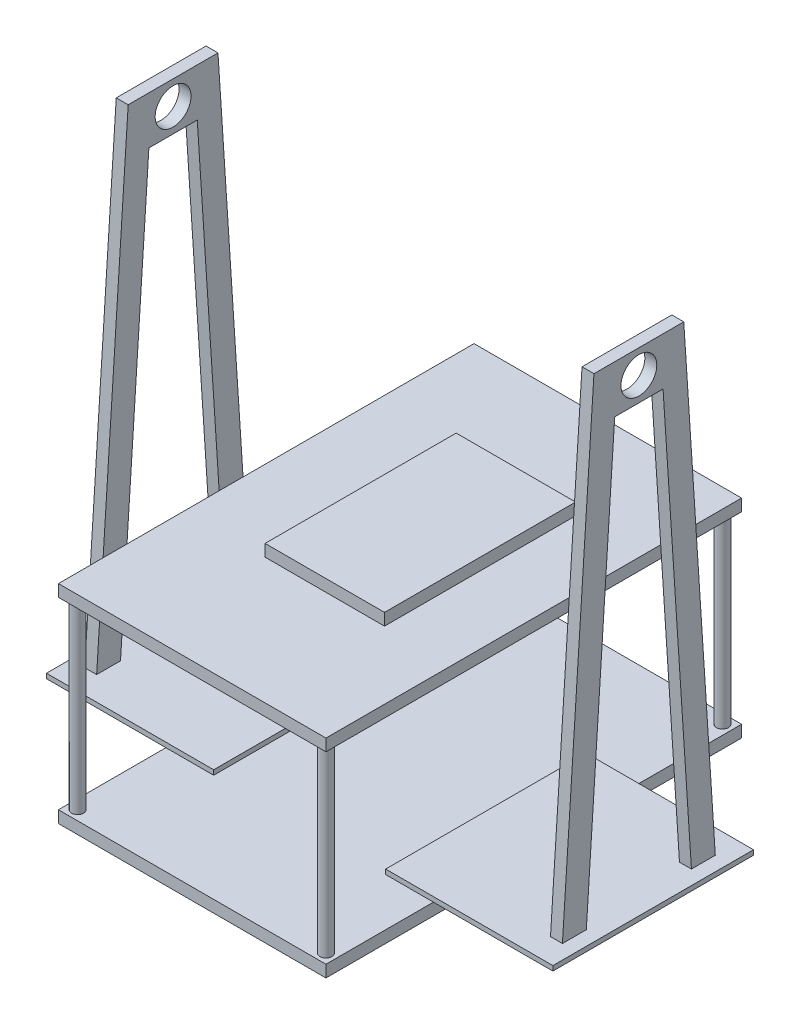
ISO-10303-21;
HEADER;
FILE_DESCRIPTION(('STEP AP214'),'2;1');
FILE_NAME('part.step','',(''),(''),'','','');
FILE_SCHEMA(('AUTOMOTIVE_DESIGN { 1 0 10303 214 1 1 1 1 }'));
ENDSEC;
DATA;
#1=APPLICATION_CONTEXT('core data for automotive mechanical design processes');
#2=APPLICATION_PROTOCOL_DEFINITION('international standard','automotive_design',2000,#1);
#3=PRODUCT_CONTEXT('',#1,'mechanical');
#4=PRODUCT('Part','Part','',(#3));
#5=PRODUCT_RELATED_PRODUCT_CATEGORY('part','',(#4));
#6=PRODUCT_DEFINITION_FORMATION('','',#4);
#7=PRODUCT_DEFINITION_CONTEXT('part definition',#1,'design');
#8=PRODUCT_DEFINITION('design','',#6,#7);
#9=PRODUCT_DEFINITION_SHAPE('','',#8);
#10=(LENGTH_UNIT() NAMED_UNIT(*) SI_UNIT(.MILLI.,.METRE.));
#11=(NAMED_UNIT(*) PLANE_ANGLE_UNIT() SI_UNIT($,.RADIAN.));
#12=(NAMED_UNIT(*) SI_UNIT($,.STERADIAN.) SOLID_ANGLE_UNIT());
#13=UNCERTAINTY_MEASURE_WITH_UNIT(LENGTH_MEASURE(1.E-05),#10,'distance_accuracy_value','');
#14=(GEOMETRIC_REPRESENTATION_CONTEXT(3) GLOBAL_UNCERTAINTY_ASSIGNED_CONTEXT((#13)) GLOBAL_UNIT_ASSIGNED_CONTEXT((#10,
#11,#12)) REPRESENTATION_CONTEXT('',''));
#15=CARTESIAN_POINT('',(0.,0.,0.));
#16=DIRECTION('',(0.,0.,1.));
#17=DIRECTION('',(1.,0.,0.));
#18=AXIS2_PLACEMENT_3D('',#15,#16,#17);
#19=CARTESIAN_POINT('',(-71.12,3.175,220.98));
#20=DIRECTION('',(0.,-1.,0.));
#21=DIRECTION('',(0.,0.,-1.));
#22=AXIS2_PLACEMENT_3D('',#19,#20,#21);
#23=PLANE('',#22);
#24=CARTESIAN_POINT('',(-66.04,3.175,215.9));
#25=DIRECTION('',(0.,-1.,0.));
#26=DIRECTION('',(0.,0.,-1.));
#27=AXIS2_PLACEMENT_3D('',#24,#25,#26);
#28=CIRCLE('',#27,3.175);
#29=CARTESIAN_POINT('',(-66.04,3.175,212.725));
#30=VERTEX_POINT('',#29);
#31=EDGE_CURVE('E452',#30,#30,#28,.T.);
#32=ORIENTED_EDGE('',*,*,#31,.T.);
#33=EDGE_LOOP('',(#32));
#34=FACE_BOUND('',#33,.T.);
#35=CARTESIAN_POINT('',(66.04,3.175,215.9));
#36=DIRECTION('',(0.,-1.,0.));
#37=DIRECTION('',(0.,0.,-1.));
#38=AXIS2_PLACEMENT_3D('',#35,#36,#37);
#39=CIRCLE('',#38,3.175);
#40=CARTESIAN_POINT('',(66.04,3.175,212.725));
#41=VERTEX_POINT('',#40);
#42=EDGE_CURVE('E11',#41,#41,#39,.F.);
#43=ORIENTED_EDGE('',*,*,#42,.F.);
#44=EDGE_LOOP('',(#43));
#45=FACE_BOUND('',#44,.T.);
#46=CARTESIAN_POINT('',(66.04,3.175,5.08));
#47=DIRECTION('',(0.,-1.,0.));
#48=DIRECTION('',(0.,0.,1.));
#49=AXIS2_PLACEMENT_3D('',#46,#47,#48);
#50=CIRCLE('',#49,3.175);
#51=CARTESIAN_POINT('',(66.04,3.175,8.255));
#52=VERTEX_POINT('',#51);
#53=EDGE_CURVE('E458',#52,#52,#50,.T.);
#54=ORIENTED_EDGE('',*,*,#53,.T.);
#55=EDGE_LOOP('',(#54));
#56=FACE_BOUND('',#55,.T.);
#57=CARTESIAN_POINT('',(-66.04,3.175,5.08));
#58=DIRECTION('',(0.,-1.,0.));
#59=DIRECTION('',(0.,0.,-1.));
#60=AXIS2_PLACEMENT_3D('',#57,#58,#59);
#61=CIRCLE('',#60,3.175);
#62=CARTESIAN_POINT('',(-66.04,3.175,1.905));
#63=VERTEX_POINT('',#62);
#64=EDGE_CURVE('E44',#63,#63,#61,.F.);
#65=ORIENTED_EDGE('',*,*,#64,.F.);
#66=EDGE_LOOP('',(#65));
#67=FACE_BOUND('',#66,.T.);
#68=DIRECTION('',(1.,0.,0.));
#69=VECTOR('',#68,1.);
#70=CARTESIAN_POINT('',(45.72,3.175,163.83));
#71=LINE('',#70,#69);
#72=CARTESIAN_POINT('',(45.72,3.175,163.83));
#73=VERTEX_POINT('',#72);
#74=CARTESIAN_POINT('',(71.12,3.175,163.83));
#75=VERTEX_POINT('',#74);
#76=EDGE_CURVE('E481',#73,#75,#71,.T.);
#77=ORIENTED_EDGE('',*,*,#76,.F.);
#78=DIRECTION('',(0.,0.,1.));
#79=VECTOR('',#78,1.);
#80=CARTESIAN_POINT('',(45.72,3.175,57.15));
#81=LINE('',#80,#79);
#82=CARTESIAN_POINT('',(45.72,3.175,57.15));
#83=VERTEX_POINT('',#82);
#84=EDGE_CURVE('E466',#83,#73,#81,.T.);
#85=ORIENTED_EDGE('',*,*,#84,.F.);
#86=DIRECTION('',(-1.,0.,0.));
#87=VECTOR('',#86,1.);
#88=CARTESIAN_POINT('',(45.72,3.175,57.15));
#89=LINE('',#88,#87);
#90=CARTESIAN_POINT('',(71.12,3.175,57.15));
#91=VERTEX_POINT('',#90);
#92=EDGE_CURVE('E486',#91,#83,#89,.T.);
#93=ORIENTED_EDGE('',*,*,#92,.F.);
#94=DIRECTION('',(0.,0.,-1.));
#95=VECTOR('',#94,1.);
#96=CARTESIAN_POINT('',(71.12,3.175,220.98));
#97=LINE('',#96,#95);
#98=CARTESIAN_POINT('',(71.12,3.175,0.));
#99=VERTEX_POINT('',#98);
#100=EDGE_CURVE('E564',#91,#99,#97,.T.);
#101=ORIENTED_EDGE('',*,*,#100,.T.);
#102=DIRECTION('',(-1.,0.,0.));
#103=VECTOR('',#102,1.);
#104=CARTESIAN_POINT('',(-71.12,3.175,0.));
#105=LINE('',#104,#103);
#106=CARTESIAN_POINT('',(-71.12,3.175,0.));
#107=VERTEX_POINT('',#106);
#108=EDGE_CURVE('E549',#99,#107,#105,.T.);
#109=ORIENTED_EDGE('',*,*,#108,.T.);
#110=DIRECTION('',(0.,0.,-1.));
#111=VECTOR('',#110,1.);
#112=CARTESIAN_POINT('',(-71.12,3.175,220.98));
#113=LINE('',#112,#111);
#114=CARTESIAN_POINT('',(-71.12,3.175,57.15));
#115=VERTEX_POINT('',#114);
#116=EDGE_CURVE('E560',#115,#107,#113,.T.);
#117=ORIENTED_EDGE('',*,*,#116,.F.);
#118=DIRECTION('',(-1.,0.,0.));
#119=VECTOR('',#118,1.);
#120=CARTESIAN_POINT('',(-134.62,3.175,57.15));
#121=LINE('',#120,#119);
#122=CARTESIAN_POINT('',(-45.72,3.175,57.15));
#123=VERTEX_POINT('',#122);
#124=EDGE_CURVE('E505',#123,#115,#121,.T.);
#125=ORIENTED_EDGE('',*,*,#124,.F.);
#126=DIRECTION('',(0.,0.,-1.));
#127=VECTOR('',#126,1.);
#128=CARTESIAN_POINT('',(-45.72,3.175,57.15));
#129=LINE('',#128,#127);
#130=CARTESIAN_POINT('',(-45.7199999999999,3.175,163.83));
#131=VERTEX_POINT('',#130);
#132=EDGE_CURVE('E517',#131,#123,#129,.T.);
#133=ORIENTED_EDGE('',*,*,#132,.F.);
#134=DIRECTION('',(1.,0.,0.));
#135=VECTOR('',#134,1.);
#136=CARTESIAN_POINT('',(-134.62,3.175,163.83));
#137=LINE('',#136,#135);
#138=CARTESIAN_POINT('',(-71.12,3.175,163.83));
#139=VERTEX_POINT('',#138);
#140=EDGE_CURVE('E518',#139,#131,#137,.T.);
#141=ORIENTED_EDGE('',*,*,#140,.F.);
#142=CARTESIAN_POINT('',(-71.12,3.175,220.98));
#143=VERTEX_POINT('',#142);
#144=EDGE_CURVE('E561',#143,#139,#113,.T.);
#145=ORIENTED_EDGE('',*,*,#144,.F.);
#146=DIRECTION('',(-1.,0.,0.));
#147=VECTOR('',#146,1.);
#148=CARTESIAN_POINT('',(-71.12,3.175,220.98));
#149=LINE('',#148,#147);
#150=CARTESIAN_POINT('',(71.12,3.175,220.98));
#151=VERTEX_POINT('',#150);
#152=EDGE_CURVE('E539',#151,#143,#149,.T.);
#153=ORIENTED_EDGE('',*,*,#152,.F.);
#154=EDGE_CURVE('E566',#151,#75,#97,.T.);
#155=ORIENTED_EDGE('',*,*,#154,.T.);
#156=EDGE_LOOP('',(#77,#85,#93,#101,#109,#117,#125,#133,#141,#145,#153,#155));
#157=FACE_BOUND('',#156,.T.);
#158=ADVANCED_FACE('F35',(#34,#45,#56,#67,#157),#23,.F.);
#159=CARTESIAN_POINT('',(71.12,-3.175,220.98));
#160=DIRECTION('',(-1.,0.,0.));
#161=DIRECTION('',(0.,0.,1.));
#162=AXIS2_PLACEMENT_3D('',#159,#160,#161);
#163=PLANE('',#162);
#164=DIRECTION('',(0.,1.,0.));
#165=VECTOR('',#164,1.);
#166=CARTESIAN_POINT('',(71.12,-3.175,0.));
#167=LINE('',#166,#165);
#168=CARTESIAN_POINT('',(71.12,-3.175,0.));
#169=VERTEX_POINT('',#168);
#170=EDGE_CURVE('E535',#169,#99,#167,.T.);
#171=ORIENTED_EDGE('',*,*,#170,.T.);
#172=ORIENTED_EDGE('',*,*,#100,.F.);
#173=EDGE_CURVE('E569',#75,#91,#97,.T.);
#174=ORIENTED_EDGE('',*,*,#173,.F.);
#175=ORIENTED_EDGE('',*,*,#154,.F.);
#176=DIRECTION('',(0.,1.,0.));
#177=VECTOR('',#176,1.);
#178=CARTESIAN_POINT('',(71.12,-3.175,220.98));
#179=LINE('',#178,#177);
#180=CARTESIAN_POINT('',(71.12,-3.175,220.98));
#181=VERTEX_POINT('',#180);
#182=EDGE_CURVE('E536',#181,#151,#179,.T.);
#183=ORIENTED_EDGE('',*,*,#182,.F.);
#184=DIRECTION('',(0.,0.,-1.));
#185=VECTOR('',#184,1.);
#186=CARTESIAN_POINT('',(71.12,-3.175,220.98));
#187=LINE('',#186,#185);
#188=EDGE_CURVE('E546',#181,#169,#187,.T.);
#189=ORIENTED_EDGE('',*,*,#188,.T.);
#190=EDGE_LOOP('',(#171,#172,#174,#175,#183,#189));
#191=FACE_BOUND('',#190,.T.);
#192=ADVANCED_FACE('F37',(#191),#163,.F.);
#193=CARTESIAN_POINT('',(-71.12,-3.175,220.98));
#194=DIRECTION('',(1.,0.,0.));
#195=DIRECTION('',(0.,0.,-1.));
#196=AXIS2_PLACEMENT_3D('',#193,#194,#195);
#197=PLANE('',#196);
#198=DIRECTION('',(0.,-1.,0.));
#199=VECTOR('',#198,1.);
#200=CARTESIAN_POINT('',(-71.12,-3.175,0.));
#201=LINE('',#200,#199);
#202=CARTESIAN_POINT('',(-71.12,-3.175,0.));
#203=VERTEX_POINT('',#202);
#204=EDGE_CURVE('E552',#107,#203,#201,.T.);
#205=ORIENTED_EDGE('',*,*,#204,.T.);
#206=DIRECTION('',(0.,0.,-1.));
#207=VECTOR('',#206,1.);
#208=CARTESIAN_POINT('',(-71.12,-3.175,220.98));
#209=LINE('',#208,#207);
#210=CARTESIAN_POINT('',(-71.12,-3.175,220.98));
#211=VERTEX_POINT('',#210);
#212=EDGE_CURVE('E557',#211,#203,#209,.T.);
#213=ORIENTED_EDGE('',*,*,#212,.F.);
#214=DIRECTION('',(0.,-1.,0.));
#215=VECTOR('',#214,1.);
#216=CARTESIAN_POINT('',(-71.12,-3.175,220.98));
#217=LINE('',#216,#215);
#218=EDGE_CURVE('E542',#143,#211,#217,.T.);
#219=ORIENTED_EDGE('',*,*,#218,.F.);
#220=ORIENTED_EDGE('',*,*,#144,.T.);
#221=EDGE_CURVE('E565',#139,#115,#113,.T.);
#222=ORIENTED_EDGE('',*,*,#221,.T.);
#223=ORIENTED_EDGE('',*,*,#116,.T.);
#224=EDGE_LOOP('',(#205,#213,#219,#220,#222,#223));
#225=FACE_BOUND('',#224,.T.);
#226=ADVANCED_FACE('F685',(#225),#197,.F.);
#227=CARTESIAN_POINT('',(-71.12,-3.175,220.98));
#228=DIRECTION('',(0.,1.,0.));
#229=DIRECTION('',(0.,0.,1.));
#230=AXIS2_PLACEMENT_3D('',#227,#228,#229);
#231=PLANE('',#230);
#232=DIRECTION('',(1.,0.,0.));
#233=VECTOR('',#232,1.);
#234=CARTESIAN_POINT('',(-71.12,-3.175,0.));
#235=LINE('',#234,#233);
#236=EDGE_CURVE('E540',#203,#169,#235,.T.);
#237=ORIENTED_EDGE('',*,*,#236,.T.);
#238=ORIENTED_EDGE('',*,*,#188,.F.);
#239=DIRECTION('',(1.,0.,0.));
#240=VECTOR('',#239,1.);
#241=CARTESIAN_POINT('',(-71.12,-3.175,220.98));
#242=LINE('',#241,#240);
#243=EDGE_CURVE('E544',#211,#181,#242,.T.);
#244=ORIENTED_EDGE('',*,*,#243,.F.);
#245=ORIENTED_EDGE('',*,*,#212,.T.);
#246=EDGE_LOOP('',(#237,#238,#244,#245));
#247=FACE_BOUND('',#246,.T.);
#248=ADVANCED_FACE('F728',(#247),#231,.F.);
#249=CARTESIAN_POINT('',(0.,0.,220.98));
#250=DIRECTION('',(0.,0.,-1.));
#251=DIRECTION('',(-1.,0.,0.));
#252=AXIS2_PLACEMENT_3D('',#249,#250,#251);
#253=PLANE('',#252);
#254=ORIENTED_EDGE('',*,*,#182,.T.);
#255=ORIENTED_EDGE('',*,*,#152,.T.);
#256=ORIENTED_EDGE('',*,*,#218,.T.);
#257=ORIENTED_EDGE('',*,*,#243,.T.);
#258=EDGE_LOOP('',(#254,#255,#256,#257));
#259=FACE_BOUND('',#258,.T.);
#260=ADVANCED_FACE('F672',(#259),#253,.F.);
#261=CARTESIAN_POINT('',(0.,0.,0.));
#262=DIRECTION('',(0.,0.,-1.));
#263=DIRECTION('',(-1.,0.,0.));
#264=AXIS2_PLACEMENT_3D('',#261,#262,#263);
#265=PLANE('',#264);
#266=ORIENTED_EDGE('',*,*,#170,.F.);
#267=ORIENTED_EDGE('',*,*,#236,.F.);
#268=ORIENTED_EDGE('',*,*,#204,.F.);
#269=ORIENTED_EDGE('',*,*,#108,.F.);
#270=EDGE_LOOP('',(#266,#267,#268,#269));
#271=FACE_BOUND('',#270,.T.);
#272=ADVANCED_FACE('F679',(#271),#265,.T.);
#273=CARTESIAN_POINT('',(-134.62,5.715,57.15));
#274=DIRECTION('',(1.,0.,0.));
#275=DIRECTION('',(0.,0.,-1.));
#276=AXIS2_PLACEMENT_3D('',#273,#274,#275);
#277=PLANE('',#276);
#278=DIRECTION('',(0.,0.,1.));
#279=VECTOR('',#278,1.);
#280=CARTESIAN_POINT('',(-134.62,3.175,57.15));
#281=LINE('',#280,#279);
#282=CARTESIAN_POINT('',(-134.62,3.175,57.15));
#283=VERTEX_POINT('',#282);
#284=CARTESIAN_POINT('',(-134.62,3.175,163.83));
#285=VERTEX_POINT('',#284);
#286=EDGE_CURVE('E500',#283,#285,#281,.T.);
#287=ORIENTED_EDGE('',*,*,#286,.T.);
#288=DIRECTION('',(0.,-1.,0.));
#289=VECTOR('',#288,1.);
#290=CARTESIAN_POINT('',(-134.62,5.715,163.83));
#291=LINE('',#290,#289);
#292=CARTESIAN_POINT('',(-134.62,5.715,163.83));
#293=VERTEX_POINT('',#292);
#294=EDGE_CURVE('E532',#293,#285,#291,.T.);
#295=ORIENTED_EDGE('',*,*,#294,.F.);
#296=DIRECTION('',(0.,0.,1.));
#297=VECTOR('',#296,1.);
#298=CARTESIAN_POINT('',(-134.62,5.715,57.15));
#299=LINE('',#298,#297);
#300=CARTESIAN_POINT('',(-134.62,5.715,57.15));
#301=VERTEX_POINT('',#300);
#302=EDGE_CURVE('E501',#301,#293,#299,.T.);
#303=ORIENTED_EDGE('',*,*,#302,.F.);
#304=DIRECTION('',(0.,-1.,0.));
#305=VECTOR('',#304,1.);
#306=CARTESIAN_POINT('',(-134.62,5.715,57.15));
#307=LINE('',#306,#305);
#308=EDGE_CURVE('E511',#301,#283,#307,.T.);
#309=ORIENTED_EDGE('',*,*,#308,.T.);
#310=EDGE_LOOP('',(#287,#295,#303,#309));
#311=FACE_BOUND('',#310,.T.);
#312=ADVANCED_FACE('F704',(#311),#277,.F.);
#313=CARTESIAN_POINT('',(-134.62,5.715,163.83));
#314=DIRECTION('',(0.,0.,-1.));
#315=DIRECTION('',(-1.,0.,0.));
#316=AXIS2_PLACEMENT_3D('',#313,#314,#315);
#317=PLANE('',#316);
#318=EDGE_CURVE('E514',#285,#139,#137,.T.);
#319=ORIENTED_EDGE('',*,*,#318,.T.);
#320=ORIENTED_EDGE('',*,*,#140,.T.);
#321=DIRECTION('',(0.,-1.,0.));
#322=VECTOR('',#321,1.);
#323=CARTESIAN_POINT('',(-45.7199999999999,5.715,163.83));
#324=LINE('',#323,#322);
#325=CARTESIAN_POINT('',(-45.7199999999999,5.715,163.83));
#326=VERTEX_POINT('',#325);
#327=EDGE_CURVE('E529',#326,#131,#324,.T.);
#328=ORIENTED_EDGE('',*,*,#327,.F.);
#329=DIRECTION('',(1.,0.,0.));
#330=VECTOR('',#329,1.);
#331=CARTESIAN_POINT('',(-134.62,5.715,163.83));
#332=LINE('',#331,#330);
#333=EDGE_CURVE('E504',#293,#326,#332,.T.);
#334=ORIENTED_EDGE('',*,*,#333,.F.);
#335=ORIENTED_EDGE('',*,*,#294,.T.);
#336=EDGE_LOOP('',(#319,#320,#328,#334,#335));
#337=FACE_BOUND('',#336,.T.);
#338=ADVANCED_FACE('F700',(#337),#317,.F.);
#339=CARTESIAN_POINT('',(-45.72,5.715,57.15));
#340=DIRECTION('',(-1.,0.,0.));
#341=DIRECTION('',(0.,0.,1.));
#342=AXIS2_PLACEMENT_3D('',#339,#340,#341);
#343=PLANE('',#342);
#344=ORIENTED_EDGE('',*,*,#132,.T.);
#345=DIRECTION('',(0.,-1.,0.));
#346=VECTOR('',#345,1.);
#347=CARTESIAN_POINT('',(-45.72,5.715,57.15));
#348=LINE('',#347,#346);
#349=CARTESIAN_POINT('',(-45.72,5.715,57.15));
#350=VERTEX_POINT('',#349);
#351=EDGE_CURVE('E526',#350,#123,#348,.T.);
#352=ORIENTED_EDGE('',*,*,#351,.F.);
#353=DIRECTION('',(0.,0.,-1.));
#354=VECTOR('',#353,1.);
#355=CARTESIAN_POINT('',(-45.72,5.715,57.15));
#356=LINE('',#355,#354);
#357=EDGE_CURVE('E507',#326,#350,#356,.T.);
#358=ORIENTED_EDGE('',*,*,#357,.F.);
#359=ORIENTED_EDGE('',*,*,#327,.T.);
#360=EDGE_LOOP('',(#344,#352,#358,#359));
#361=FACE_BOUND('',#360,.T.);
#362=ADVANCED_FACE('F696',(#361),#343,.F.);
#363=CARTESIAN_POINT('',(-134.62,5.715,57.15));
#364=DIRECTION('',(0.,0.,1.));
#365=DIRECTION('',(1.,0.,0.));
#366=AXIS2_PLACEMENT_3D('',#363,#364,#365);
#367=PLANE('',#366);
#368=ORIENTED_EDGE('',*,*,#124,.T.);
#369=EDGE_CURVE('E521',#115,#283,#121,.T.);
#370=ORIENTED_EDGE('',*,*,#369,.T.);
#371=ORIENTED_EDGE('',*,*,#308,.F.);
#372=DIRECTION('',(-1.,0.,0.));
#373=VECTOR('',#372,1.);
#374=CARTESIAN_POINT('',(-134.62,5.715,57.15));
#375=LINE('',#374,#373);
#376=EDGE_CURVE('E509',#350,#301,#375,.T.);
#377=ORIENTED_EDGE('',*,*,#376,.F.);
#378=ORIENTED_EDGE('',*,*,#351,.T.);
#379=EDGE_LOOP('',(#368,#370,#371,#377,#378));
#380=FACE_BOUND('',#379,.T.);
#381=ADVANCED_FACE('F691',(#380),#367,.F.);
#382=CARTESIAN_POINT('',(0.,5.715,0.));
#383=DIRECTION('',(0.,1.,0.));
#384=DIRECTION('',(0.,0.,1.));
#385=AXIS2_PLACEMENT_3D('',#382,#383,#384);
#386=PLANE('',#385);
#387=DIRECTION('',(0.,0.,1.));
#388=VECTOR('',#387,1.);
#389=CARTESIAN_POINT('',(-127.,5.715,69.85));
#390=LINE('',#389,#388);
#391=CARTESIAN_POINT('',(-127.,5.715,69.85));
#392=VERTEX_POINT('',#391);
#393=CARTESIAN_POINT('',(-127.,5.715,82.55));
#394=VERTEX_POINT('',#393);
#395=EDGE_CURVE('E328',#392,#394,#390,.T.);
#396=ORIENTED_EDGE('',*,*,#395,.F.);
#397=DIRECTION('',(1.,0.,0.));
#398=VECTOR('',#397,1.);
#399=CARTESIAN_POINT('',(-127.,5.715,69.85));
#400=LINE('',#399,#398);
#401=CARTESIAN_POINT('',(-120.65,5.715,69.85));
#402=VERTEX_POINT('',#401);
#403=EDGE_CURVE('E375',#392,#402,#400,.T.);
#404=ORIENTED_EDGE('',*,*,#403,.T.);
#405=DIRECTION('',(0.,0.,1.));
#406=VECTOR('',#405,1.);
#407=CARTESIAN_POINT('',(-120.65,5.715,69.85));
#408=LINE('',#407,#406);
#409=CARTESIAN_POINT('',(-120.65,5.715,82.55));
#410=VERTEX_POINT('',#409);
#411=EDGE_CURVE('E350',#402,#410,#408,.T.);
#412=ORIENTED_EDGE('',*,*,#411,.T.);
#413=DIRECTION('',(1.,0.,0.));
#414=VECTOR('',#413,1.);
#415=CARTESIAN_POINT('',(-127.,5.715,82.55));
#416=LINE('',#415,#414);
#417=EDGE_CURVE('E378',#394,#410,#416,.T.);
#418=ORIENTED_EDGE('',*,*,#417,.F.);
#419=EDGE_LOOP('',(#396,#404,#412,#418));
#420=FACE_BOUND('',#419,.T.);
#421=DIRECTION('',(0.,0.,-1.));
#422=VECTOR('',#421,1.);
#423=CARTESIAN_POINT('',(-127.,5.715,151.13));
#424=LINE('',#423,#422);
#425=CARTESIAN_POINT('',(-127.,5.715,151.13));
#426=VERTEX_POINT('',#425);
#427=CARTESIAN_POINT('',(-127.,5.715,138.43));
#428=VERTEX_POINT('',#427);
#429=EDGE_CURVE('E338',#426,#428,#424,.T.);
#430=ORIENTED_EDGE('',*,*,#429,.T.);
#431=DIRECTION('',(1.,0.,0.));
#432=VECTOR('',#431,1.);
#433=CARTESIAN_POINT('',(-127.,5.715,138.43));
#434=LINE('',#433,#432);
#435=CARTESIAN_POINT('',(-120.65,5.715,138.43));
#436=VERTEX_POINT('',#435);
#437=EDGE_CURVE('E364',#428,#436,#434,.T.);
#438=ORIENTED_EDGE('',*,*,#437,.T.);
#439=DIRECTION('',(0.,0.,-1.));
#440=VECTOR('',#439,1.);
#441=CARTESIAN_POINT('',(-120.65,5.715,151.13));
#442=LINE('',#441,#440);
#443=CARTESIAN_POINT('',(-120.65,5.715,151.13));
#444=VERTEX_POINT('',#443);
#445=EDGE_CURVE('E323',#444,#436,#442,.T.);
#446=ORIENTED_EDGE('',*,*,#445,.F.);
#447=DIRECTION('',(1.,0.,0.));
#448=VECTOR('',#447,1.);
#449=CARTESIAN_POINT('',(-127.,5.715,151.13));
#450=LINE('',#449,#448);
#451=EDGE_CURVE('E368',#426,#444,#450,.T.);
#452=ORIENTED_EDGE('',*,*,#451,.F.);
#453=EDGE_LOOP('',(#430,#438,#446,#452));
#454=FACE_BOUND('',#453,.T.);
#455=ORIENTED_EDGE('',*,*,#302,.T.);
#456=ORIENTED_EDGE('',*,*,#333,.T.);
#457=ORIENTED_EDGE('',*,*,#357,.T.);
#458=ORIENTED_EDGE('',*,*,#376,.T.);
#459=EDGE_LOOP('',(#455,#456,#457,#458));
#460=FACE_BOUND('',#459,.T.);
#461=ADVANCED_FACE('F706',(#420,#454,#460),#386,.T.);
#462=CARTESIAN_POINT('',(0.,3.175,0.));
#463=DIRECTION('',(0.,1.,0.));
#464=DIRECTION('',(0.,0.,1.));
#465=AXIS2_PLACEMENT_3D('',#462,#463,#464);
#466=PLANE('',#465);
#467=ORIENTED_EDGE('',*,*,#221,.F.);
#468=ORIENTED_EDGE('',*,*,#318,.F.);
#469=ORIENTED_EDGE('',*,*,#286,.F.);
#470=ORIENTED_EDGE('',*,*,#369,.F.);
#471=EDGE_LOOP('',(#467,#468,#469,#470));
#472=FACE_BOUND('',#471,.T.);
#473=ADVANCED_FACE('F688',(#472),#466,.F.);
#474=CARTESIAN_POINT('',(0.,3.175,0.));
#475=DIRECTION('',(0.,1.,0.));
#476=DIRECTION('',(0.,0.,1.));
#477=AXIS2_PLACEMENT_3D('',#474,#475,#476);
#478=PLANE('',#477);
#479=CARTESIAN_POINT('',(134.62,3.175,163.83));
#480=VERTEX_POINT('',#479);
#481=EDGE_CURVE('E480',#75,#480,#71,.T.);
#482=ORIENTED_EDGE('',*,*,#481,.F.);
#483=ORIENTED_EDGE('',*,*,#173,.T.);
#484=CARTESIAN_POINT('',(134.62,3.175,57.15));
#485=VERTEX_POINT('',#484);
#486=EDGE_CURVE('E471',#485,#91,#89,.T.);
#487=ORIENTED_EDGE('',*,*,#486,.F.);
#488=DIRECTION('',(0.,0.,-1.));
#489=VECTOR('',#488,1.);
#490=CARTESIAN_POINT('',(134.62,3.175,57.15));
#491=LINE('',#490,#489);
#492=EDGE_CURVE('E484',#480,#485,#491,.T.);
#493=ORIENTED_EDGE('',*,*,#492,.F.);
#494=EDGE_LOOP('',(#482,#483,#487,#493));
#495=FACE_BOUND('',#494,.T.);
#496=ADVANCED_FACE('F665',(#495),#478,.F.);
#497=CARTESIAN_POINT('',(45.72,5.715,57.15));
#498=DIRECTION('',(1.,0.,0.));
#499=DIRECTION('',(0.,0.,-1.));
#500=AXIS2_PLACEMENT_3D('',#497,#498,#499);
#501=PLANE('',#500);
#502=ORIENTED_EDGE('',*,*,#84,.T.);
#503=DIRECTION('',(0.,-1.,0.));
#504=VECTOR('',#503,1.);
#505=CARTESIAN_POINT('',(45.72,5.715,163.83));
#506=LINE('',#505,#504);
#507=CARTESIAN_POINT('',(45.72,5.715,163.83));
#508=VERTEX_POINT('',#507);
#509=EDGE_CURVE('E497',#508,#73,#506,.T.);
#510=ORIENTED_EDGE('',*,*,#509,.F.);
#511=DIRECTION('',(0.,0.,1.));
#512=VECTOR('',#511,1.);
#513=CARTESIAN_POINT('',(45.72,5.715,57.15));
#514=LINE('',#513,#512);
#515=CARTESIAN_POINT('',(45.72,5.715,57.15));
#516=VERTEX_POINT('',#515);
#517=EDGE_CURVE('E467',#516,#508,#514,.T.);
#518=ORIENTED_EDGE('',*,*,#517,.F.);
#519=DIRECTION('',(0.,-1.,0.));
#520=VECTOR('',#519,1.);
#521=CARTESIAN_POINT('',(45.72,5.715,57.15));
#522=LINE('',#521,#520);
#523=EDGE_CURVE('E477',#516,#83,#522,.T.);
#524=ORIENTED_EDGE('',*,*,#523,.T.);
#525=EDGE_LOOP('',(#502,#510,#518,#524));
#526=FACE_BOUND('',#525,.T.);
#527=ADVANCED_FACE('F648',(#526),#501,.F.);
#528=CARTESIAN_POINT('',(45.72,5.715,163.83));
#529=DIRECTION('',(0.,0.,-1.));
#530=DIRECTION('',(-1.,0.,0.));
#531=AXIS2_PLACEMENT_3D('',#528,#529,#530);
#532=PLANE('',#531);
#533=ORIENTED_EDGE('',*,*,#76,.T.);
#534=ORIENTED_EDGE('',*,*,#481,.T.);
#535=DIRECTION('',(0.,-1.,0.));
#536=VECTOR('',#535,1.);
#537=CARTESIAN_POINT('',(134.62,5.715,163.83));
#538=LINE('',#537,#536);
#539=CARTESIAN_POINT('',(134.62,5.715,163.83));
#540=VERTEX_POINT('',#539);
#541=EDGE_CURVE('E494',#540,#480,#538,.T.);
#542=ORIENTED_EDGE('',*,*,#541,.F.);
#543=DIRECTION('',(1.,0.,0.));
#544=VECTOR('',#543,1.);
#545=CARTESIAN_POINT('',(45.72,5.715,163.83));
#546=LINE('',#545,#544);
#547=EDGE_CURVE('E470',#508,#540,#546,.T.);
#548=ORIENTED_EDGE('',*,*,#547,.F.);
#549=ORIENTED_EDGE('',*,*,#509,.T.);
#550=EDGE_LOOP('',(#533,#534,#542,#548,#549));
#551=FACE_BOUND('',#550,.T.);
#552=ADVANCED_FACE('F650',(#551),#532,.F.);
#553=CARTESIAN_POINT('',(134.62,5.715,57.15));
#554=DIRECTION('',(-1.,0.,0.));
#555=DIRECTION('',(0.,0.,1.));
#556=AXIS2_PLACEMENT_3D('',#553,#554,#555);
#557=PLANE('',#556);
#558=ORIENTED_EDGE('',*,*,#492,.T.);
#559=DIRECTION('',(0.,-1.,0.));
#560=VECTOR('',#559,1.);
#561=CARTESIAN_POINT('',(134.62,5.715,57.15));
#562=LINE('',#561,#560);
#563=CARTESIAN_POINT('',(134.62,5.715,57.15));
#564=VERTEX_POINT('',#563);
#565=EDGE_CURVE('E491',#564,#485,#562,.T.);
#566=ORIENTED_EDGE('',*,*,#565,.F.);
#567=DIRECTION('',(0.,0.,-1.));
#568=VECTOR('',#567,1.);
#569=CARTESIAN_POINT('',(134.62,5.715,57.15));
#570=LINE('',#569,#568);
#571=EDGE_CURVE('E473',#540,#564,#570,.T.);
#572=ORIENTED_EDGE('',*,*,#571,.F.);
#573=ORIENTED_EDGE('',*,*,#541,.T.);
#574=EDGE_LOOP('',(#558,#566,#572,#573));
#575=FACE_BOUND('',#574,.T.);
#576=ADVANCED_FACE('F656',(#575),#557,.F.);
#577=CARTESIAN_POINT('',(45.72,5.715,57.15));
#578=DIRECTION('',(0.,0.,1.));
#579=DIRECTION('',(1.,0.,0.));
#580=AXIS2_PLACEMENT_3D('',#577,#578,#579);
#581=PLANE('',#580);
#582=ORIENTED_EDGE('',*,*,#486,.T.);
#583=ORIENTED_EDGE('',*,*,#92,.T.);
#584=ORIENTED_EDGE('',*,*,#523,.F.);
#585=DIRECTION('',(-1.,0.,0.));
#586=VECTOR('',#585,1.);
#587=CARTESIAN_POINT('',(45.72,5.715,57.15));
#588=LINE('',#587,#586);
#589=EDGE_CURVE('E475',#564,#516,#588,.T.);
#590=ORIENTED_EDGE('',*,*,#589,.F.);
#591=ORIENTED_EDGE('',*,*,#565,.T.);
#592=EDGE_LOOP('',(#582,#583,#584,#590,#591));
#593=FACE_BOUND('',#592,.T.);
#594=ADVANCED_FACE('F640',(#593),#581,.F.);
#595=CARTESIAN_POINT('',(0.,5.715,0.));
#596=DIRECTION('',(0.,1.,0.));
#597=DIRECTION('',(0.,0.,1.));
#598=AXIS2_PLACEMENT_3D('',#595,#596,#597);
#599=PLANE('',#598);
#600=DIRECTION('',(0.,0.,-1.));
#601=VECTOR('',#600,1.);
#602=CARTESIAN_POINT('',(127.,5.715,151.13));
#603=LINE('',#602,#601);
#604=CARTESIAN_POINT('',(127.,5.715,151.13));
#605=VERTEX_POINT('',#604);
#606=CARTESIAN_POINT('',(127.,5.715,138.43));
#607=VERTEX_POINT('',#606);
#608=EDGE_CURVE('E283',#605,#607,#603,.T.);
#609=ORIENTED_EDGE('',*,*,#608,.F.);
#610=DIRECTION('',(-1.,0.,0.));
#611=VECTOR('',#610,1.);
#612=CARTESIAN_POINT('',(127.,5.715,151.13));
#613=LINE('',#612,#611);
#614=CARTESIAN_POINT('',(120.65,5.715,151.13));
#615=VERTEX_POINT('',#614);
#616=EDGE_CURVE('E305',#605,#615,#613,.T.);
#617=ORIENTED_EDGE('',*,*,#616,.T.);
#618=DIRECTION('',(0.,0.,-1.));
#619=VECTOR('',#618,1.);
#620=CARTESIAN_POINT('',(120.65,5.715,151.13));
#621=LINE('',#620,#619);
#622=CARTESIAN_POINT('',(120.65,5.715,138.43));
#623=VERTEX_POINT('',#622);
#624=EDGE_CURVE('E304',#615,#623,#621,.T.);
#625=ORIENTED_EDGE('',*,*,#624,.T.);
#626=DIRECTION('',(-1.,0.,0.));
#627=VECTOR('',#626,1.);
#628=CARTESIAN_POINT('',(127.,5.715,138.43));
#629=LINE('',#628,#627);
#630=EDGE_CURVE('E296',#607,#623,#629,.T.);
#631=ORIENTED_EDGE('',*,*,#630,.F.);
#632=EDGE_LOOP('',(#609,#617,#625,#631));
#633=FACE_BOUND('',#632,.T.);
#634=DIRECTION('',(0.,0.,1.));
#635=VECTOR('',#634,1.);
#636=CARTESIAN_POINT('',(127.,5.715,69.85));
#637=LINE('',#636,#635);
#638=CARTESIAN_POINT('',(127.,5.715,69.85));
#639=VERTEX_POINT('',#638);
#640=CARTESIAN_POINT('',(127.,5.715,82.55));
#641=VERTEX_POINT('',#640);
#642=EDGE_CURVE('E619',#639,#641,#637,.T.);
#643=ORIENTED_EDGE('',*,*,#642,.T.);
#644=DIRECTION('',(-1.,0.,0.));
#645=VECTOR('',#644,1.);
#646=CARTESIAN_POINT('',(127.,5.715,82.55));
#647=LINE('',#646,#645);
#648=CARTESIAN_POINT('',(120.65,5.715,82.55));
#649=VERTEX_POINT('',#648);
#650=EDGE_CURVE('E578',#641,#649,#647,.T.);
#651=ORIENTED_EDGE('',*,*,#650,.T.);
#652=DIRECTION('',(0.,0.,1.));
#653=VECTOR('',#652,1.);
#654=CARTESIAN_POINT('',(120.65,5.715,69.85));
#655=LINE('',#654,#653);
#656=CARTESIAN_POINT('',(120.65,5.715,69.85));
#657=VERTEX_POINT('',#656);
#658=EDGE_CURVE('E608',#657,#649,#655,.T.);
#659=ORIENTED_EDGE('',*,*,#658,.F.);
#660=DIRECTION('',(-1.,0.,0.));
#661=VECTOR('',#660,1.);
#662=CARTESIAN_POINT('',(127.,5.715,69.85));
#663=LINE('',#662,#661);
#664=EDGE_CURVE('E585',#639,#657,#663,.T.);
#665=ORIENTED_EDGE('',*,*,#664,.F.);
#666=EDGE_LOOP('',(#643,#651,#659,#665));
#667=FACE_BOUND('',#666,.T.);
#668=ORIENTED_EDGE('',*,*,#517,.T.);
#669=ORIENTED_EDGE('',*,*,#547,.T.);
#670=ORIENTED_EDGE('',*,*,#571,.T.);
#671=ORIENTED_EDGE('',*,*,#589,.T.);
#672=EDGE_LOOP('',(#668,#669,#670,#671));
#673=FACE_BOUND('',#672,.T.);
#674=ADVANCED_FACE('F302',(#633,#667,#673),#599,.T.);
#675=CARTESIAN_POINT('',(-66.04,100.965,5.08));
#676=DIRECTION('',(0.,-1.,0.));
#677=DIRECTION('',(0.,0.,-1.));
#678=AXIS2_PLACEMENT_3D('',#675,#676,#677);
#679=CYLINDRICAL_SURFACE('',#678,3.175);
#680=CARTESIAN_POINT('',(-66.04,100.965,5.08));
#681=DIRECTION('',(0.,1.,0.));
#682=DIRECTION('',(0.,0.,1.));
#683=AXIS2_PLACEMENT_3D('',#680,#681,#682);
#684=CIRCLE('',#683,3.175);
#685=CARTESIAN_POINT('',(-66.04,100.965,8.255));
#686=VERTEX_POINT('',#685);
#687=EDGE_CURVE('E463',#686,#686,#684,.T.);
#688=ORIENTED_EDGE('',*,*,#687,.F.);
#689=EDGE_LOOP('',(#688));
#690=FACE_BOUND('',#689,.T.);
#691=ORIENTED_EDGE('',*,*,#64,.T.);
#692=EDGE_LOOP('',(#691));
#693=FACE_BOUND('',#692,.T.);
#694=ADVANCED_FACE('F639',(#690,#693),#679,.T.);
#695=CARTESIAN_POINT('',(66.04,100.965,5.08));
#696=DIRECTION('',(0.,-1.,0.));
#697=DIRECTION('',(0.,0.,-1.));
#698=AXIS2_PLACEMENT_3D('',#695,#696,#697);
#699=CYLINDRICAL_SURFACE('',#698,3.175);
#700=CARTESIAN_POINT('',(66.04,100.965,5.08));
#701=DIRECTION('',(0.,-1.,0.));
#702=DIRECTION('',(0.,0.,1.));
#703=AXIS2_PLACEMENT_3D('',#700,#701,#702);
#704=CIRCLE('',#703,3.175);
#705=CARTESIAN_POINT('',(66.04,100.965,8.255));
#706=VERTEX_POINT('',#705);
#707=EDGE_CURVE('E451',#706,#706,#704,.T.);
#708=ORIENTED_EDGE('',*,*,#707,.T.);
#709=EDGE_LOOP('',(#708));
#710=FACE_BOUND('',#709,.T.);
#711=ORIENTED_EDGE('',*,*,#53,.F.);
#712=EDGE_LOOP('',(#711));
#713=FACE_BOUND('',#712,.T.);
#714=ADVANCED_FACE('F804',(#710,#713),#699,.T.);
#715=CARTESIAN_POINT('',(66.04,100.965,215.9));
#716=DIRECTION('',(0.,-1.,0.));
#717=DIRECTION('',(0.,0.,-1.));
#718=AXIS2_PLACEMENT_3D('',#715,#716,#717);
#719=CYLINDRICAL_SURFACE('',#718,3.175);
#720=CARTESIAN_POINT('',(66.04,100.965,215.9));
#721=DIRECTION('',(0.,1.,0.));
#722=DIRECTION('',(0.,0.,-1.));
#723=AXIS2_PLACEMENT_3D('',#720,#721,#722);
#724=CIRCLE('',#723,3.175);
#725=CARTESIAN_POINT('',(66.04,100.965,212.725));
#726=VERTEX_POINT('',#725);
#727=EDGE_CURVE('E455',#726,#726,#724,.T.);
#728=ORIENTED_EDGE('',*,*,#727,.F.);
#729=EDGE_LOOP('',(#728));
#730=FACE_BOUND('',#729,.T.);
#731=ORIENTED_EDGE('',*,*,#42,.T.);
#732=EDGE_LOOP('',(#731));
#733=FACE_BOUND('',#732,.T.);
#734=ADVANCED_FACE('F813',(#730,#733),#719,.T.);
#735=CARTESIAN_POINT('',(-66.04,100.965,215.9));
#736=DIRECTION('',(0.,-1.,0.));
#737=DIRECTION('',(0.,0.,-1.));
#738=AXIS2_PLACEMENT_3D('',#735,#736,#737);
#739=CYLINDRICAL_SURFACE('',#738,3.175);
#740=CARTESIAN_POINT('',(-66.04,100.965,215.9));
#741=DIRECTION('',(0.,-1.,0.));
#742=DIRECTION('',(0.,0.,-1.));
#743=AXIS2_PLACEMENT_3D('',#740,#741,#742);
#744=CIRCLE('',#743,3.175);
#745=CARTESIAN_POINT('',(-66.04,100.965,212.725));
#746=VERTEX_POINT('',#745);
#747=EDGE_CURVE('E448',#746,#746,#744,.T.);
#748=ORIENTED_EDGE('',*,*,#747,.T.);
#749=EDGE_LOOP('',(#748));
#750=FACE_BOUND('',#749,.T.);
#751=ORIENTED_EDGE('',*,*,#31,.F.);
#752=EDGE_LOOP('',(#751));
#753=FACE_BOUND('',#752,.T.);
#754=ADVANCED_FACE('F830',(#750,#753),#739,.T.);
#755=CARTESIAN_POINT('',(-71.12,100.965,220.98));
#756=DIRECTION('',(0.,-1.,0.));
#757=DIRECTION('',(0.,0.,-1.));
#758=AXIS2_PLACEMENT_3D('',#755,#756,#757);
#759=PLANE('',#758);
#760=ORIENTED_EDGE('',*,*,#727,.T.);
#761=EDGE_LOOP('',(#760));
#762=FACE_BOUND('',#761,.T.);
#763=ORIENTED_EDGE('',*,*,#747,.F.);
#764=EDGE_LOOP('',(#763));
#765=FACE_BOUND('',#764,.T.);
#766=DIRECTION('',(-1.,0.,0.));
#767=VECTOR('',#766,1.);
#768=CARTESIAN_POINT('',(-71.12,100.965,0.));
#769=LINE('',#768,#767);
#770=CARTESIAN_POINT('',(71.12,100.965,0.));
#771=VERTEX_POINT('',#770);
#772=CARTESIAN_POINT('',(-71.12,100.965,0.));
#773=VERTEX_POINT('',#772);
#774=EDGE_CURVE('E421',#771,#773,#769,.T.);
#775=ORIENTED_EDGE('',*,*,#774,.F.);
#776=DIRECTION('',(0.,0.,-1.));
#777=VECTOR('',#776,1.);
#778=CARTESIAN_POINT('',(71.12,100.965,220.98));
#779=LINE('',#778,#777);
#780=CARTESIAN_POINT('',(71.12,100.965,220.98));
#781=VERTEX_POINT('',#780);
#782=EDGE_CURVE('E430',#781,#771,#779,.T.);
#783=ORIENTED_EDGE('',*,*,#782,.F.);
#784=DIRECTION('',(-1.,0.,0.));
#785=VECTOR('',#784,1.);
#786=CARTESIAN_POINT('',(-71.12,100.965,220.98));
#787=LINE('',#786,#785);
#788=CARTESIAN_POINT('',(-71.12,100.965,220.98));
#789=VERTEX_POINT('',#788);
#790=EDGE_CURVE('E427',#781,#789,#787,.T.);
#791=ORIENTED_EDGE('',*,*,#790,.T.);
#792=DIRECTION('',(0.,0.,-1.));
#793=VECTOR('',#792,1.);
#794=CARTESIAN_POINT('',(-71.12,100.965,220.98));
#795=LINE('',#794,#793);
#796=EDGE_CURVE('E442',#789,#773,#795,.T.);
#797=ORIENTED_EDGE('',*,*,#796,.T.);
#798=EDGE_LOOP('',(#775,#783,#791,#797));
#799=FACE_BOUND('',#798,.T.);
#800=ORIENTED_EDGE('',*,*,#707,.F.);
#801=EDGE_LOOP('',(#800));
#802=FACE_BOUND('',#801,.T.);
#803=ORIENTED_EDGE('',*,*,#687,.T.);
#804=EDGE_LOOP('',(#803));
#805=FACE_BOUND('',#804,.T.);
#806=ADVANCED_FACE('F840',(#762,#765,#799,#802,#805),#759,.T.);
#807=CARTESIAN_POINT('',(71.12,107.315,220.98));
#808=DIRECTION('',(1.,0.,0.));
#809=DIRECTION('',(0.,0.,-1.));
#810=AXIS2_PLACEMENT_3D('',#807,#808,#809);
#811=PLANE('',#810);
#812=DIRECTION('',(0.,-1.,0.));
#813=VECTOR('',#812,1.);
#814=CARTESIAN_POINT('',(71.12,107.315,0.));
#815=LINE('',#814,#813);
#816=CARTESIAN_POINT('',(71.12,107.315,0.));
#817=VERTEX_POINT('',#816);
#818=EDGE_CURVE('E416',#817,#771,#815,.T.);
#819=ORIENTED_EDGE('',*,*,#818,.F.);
#820=DIRECTION('',(0.,0.,-1.));
#821=VECTOR('',#820,1.);
#822=CARTESIAN_POINT('',(71.12,107.315,220.98));
#823=LINE('',#822,#821);
#824=CARTESIAN_POINT('',(71.12,107.315,220.98));
#825=VERTEX_POINT('',#824);
#826=EDGE_CURVE('E446',#825,#817,#823,.T.);
#827=ORIENTED_EDGE('',*,*,#826,.F.);
#828=DIRECTION('',(0.,-1.,0.));
#829=VECTOR('',#828,1.);
#830=CARTESIAN_POINT('',(71.12,107.315,220.98));
#831=LINE('',#830,#829);
#832=EDGE_CURVE('E417',#825,#781,#831,.T.);
#833=ORIENTED_EDGE('',*,*,#832,.T.);
#834=ORIENTED_EDGE('',*,*,#782,.T.);
#835=EDGE_LOOP('',(#819,#827,#833,#834));
#836=FACE_BOUND('',#835,.T.);
#837=ADVANCED_FACE('F850',(#836),#811,.T.);
#838=CARTESIAN_POINT('',(-71.12,107.315,220.98));
#839=DIRECTION('',(0.,1.,0.));
#840=DIRECTION('',(0.,0.,1.));
#841=AXIS2_PLACEMENT_3D('',#838,#839,#840);
#842=PLANE('',#841);
#843=DIRECTION('',(0.,0.,-1.));
#844=VECTOR('',#843,1.);
#845=CARTESIAN_POINT('',(35.1693884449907,107.315,153.895211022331));
#846=LINE('',#845,#844);
#847=CARTESIAN_POINT('',(35.1693884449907,107.315,153.895211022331));
#848=VERTEX_POINT('',#847);
#849=CARTESIAN_POINT('',(35.1693884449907,107.315,52.2952110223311));
#850=VERTEX_POINT('',#849);
#851=EDGE_CURVE('E367',#848,#850,#846,.T.);
#852=ORIENTED_EDGE('',*,*,#851,.F.);
#853=DIRECTION('',(1.,0.,0.));
#854=VECTOR('',#853,1.);
#855=CARTESIAN_POINT('',(-28.3306115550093,107.315,153.895211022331));
#856=LINE('',#855,#854);
#857=CARTESIAN_POINT('',(-28.3306115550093,107.315,153.895211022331));
#858=VERTEX_POINT('',#857);
#859=EDGE_CURVE('E388',#858,#848,#856,.T.);
#860=ORIENTED_EDGE('',*,*,#859,.F.);
#861=DIRECTION('',(0.,0.,1.));
#862=VECTOR('',#861,1.);
#863=CARTESIAN_POINT('',(-28.3306115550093,107.315,153.895211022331));
#864=LINE('',#863,#862);
#865=CARTESIAN_POINT('',(-28.3306115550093,107.315,52.2952110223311));
#866=VERTEX_POINT('',#865);
#867=EDGE_CURVE('E400',#866,#858,#864,.T.);
#868=ORIENTED_EDGE('',*,*,#867,.F.);
#869=DIRECTION('',(-1.,0.,0.));
#870=VECTOR('',#869,1.);
#871=CARTESIAN_POINT('',(-28.3306115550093,107.315,52.2952110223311));
#872=LINE('',#871,#870);
#873=EDGE_CURVE('E397',#850,#866,#872,.T.);
#874=ORIENTED_EDGE('',*,*,#873,.F.);
#875=EDGE_LOOP('',(#852,#860,#868,#874));
#876=FACE_BOUND('',#875,.T.);
#877=DIRECTION('',(1.,0.,0.));
#878=VECTOR('',#877,1.);
#879=CARTESIAN_POINT('',(-71.12,107.315,0.));
#880=LINE('',#879,#878);
#881=CARTESIAN_POINT('',(-71.12,107.315,0.));
#882=VERTEX_POINT('',#881);
#883=EDGE_CURVE('E433',#882,#817,#880,.T.);
#884=ORIENTED_EDGE('',*,*,#883,.F.);
#885=DIRECTION('',(0.,0.,-1.));
#886=VECTOR('',#885,1.);
#887=CARTESIAN_POINT('',(-71.12,107.315,220.98));
#888=LINE('',#887,#886);
#889=CARTESIAN_POINT('',(-71.12,107.315,220.98));
#890=VERTEX_POINT('',#889);
#891=EDGE_CURVE('E444',#890,#882,#888,.T.);
#892=ORIENTED_EDGE('',*,*,#891,.F.);
#893=DIRECTION('',(1.,0.,0.));
#894=VECTOR('',#893,1.);
#895=CARTESIAN_POINT('',(-71.12,107.315,220.98));
#896=LINE('',#895,#894);
#897=EDGE_CURVE('E420',#890,#825,#896,.T.);
#898=ORIENTED_EDGE('',*,*,#897,.T.);
#899=ORIENTED_EDGE('',*,*,#826,.T.);
#900=EDGE_LOOP('',(#884,#892,#898,#899));
#901=FACE_BOUND('',#900,.T.);
#902=ADVANCED_FACE('F860',(#876,#901),#842,.T.);
#903=CARTESIAN_POINT('',(-71.12,107.315,220.98));
#904=DIRECTION('',(-1.,0.,0.));
#905=DIRECTION('',(0.,0.,1.));
#906=AXIS2_PLACEMENT_3D('',#903,#904,#905);
#907=PLANE('',#906);
#908=DIRECTION('',(0.,1.,0.));
#909=VECTOR('',#908,1.);
#910=CARTESIAN_POINT('',(-71.12,107.315,0.));
#911=LINE('',#910,#909);
#912=EDGE_CURVE('E436',#773,#882,#911,.T.);
#913=ORIENTED_EDGE('',*,*,#912,.F.);
#914=ORIENTED_EDGE('',*,*,#796,.F.);
#915=DIRECTION('',(0.,1.,0.));
#916=VECTOR('',#915,1.);
#917=CARTESIAN_POINT('',(-71.12,107.315,220.98));
#918=LINE('',#917,#916);
#919=EDGE_CURVE('E424',#789,#890,#918,.T.);
#920=ORIENTED_EDGE('',*,*,#919,.T.);
#921=ORIENTED_EDGE('',*,*,#891,.T.);
#922=EDGE_LOOP('',(#913,#914,#920,#921));
#923=FACE_BOUND('',#922,.T.);
#924=ADVANCED_FACE('F868',(#923),#907,.T.);
#925=CARTESIAN_POINT('',(0.,104.14,220.98));
#926=DIRECTION('',(0.,0.,-1.));
#927=DIRECTION('',(-1.,0.,0.));
#928=AXIS2_PLACEMENT_3D('',#925,#926,#927);
#929=PLANE('',#928);
#930=ORIENTED_EDGE('',*,*,#832,.F.);
#931=ORIENTED_EDGE('',*,*,#897,.F.);
#932=ORIENTED_EDGE('',*,*,#919,.F.);
#933=ORIENTED_EDGE('',*,*,#790,.F.);
#934=EDGE_LOOP('',(#930,#931,#932,#933));
#935=FACE_BOUND('',#934,.T.);
#936=ADVANCED_FACE('F873',(#935),#929,.F.);
#937=CARTESIAN_POINT('',(0.,104.14,0.));
#938=DIRECTION('',(0.,0.,-1.));
#939=DIRECTION('',(-1.,0.,0.));
#940=AXIS2_PLACEMENT_3D('',#937,#938,#939);
#941=PLANE('',#940);
#942=ORIENTED_EDGE('',*,*,#818,.T.);
#943=ORIENTED_EDGE('',*,*,#774,.T.);
#944=ORIENTED_EDGE('',*,*,#912,.T.);
#945=ORIENTED_EDGE('',*,*,#883,.T.);
#946=EDGE_LOOP('',(#942,#943,#944,#945));
#947=FACE_BOUND('',#946,.T.);
#948=ADVANCED_FACE('F883',(#947),#941,.T.);
#949=CARTESIAN_POINT('',(35.1693884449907,113.665,153.895211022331));
#950=DIRECTION('',(-1.,0.,0.));
#951=DIRECTION('',(0.,0.,1.));
#952=AXIS2_PLACEMENT_3D('',#949,#950,#951);
#953=PLANE('',#952);
#954=ORIENTED_EDGE('',*,*,#851,.T.);
#955=DIRECTION('',(0.,-1.,0.));
#956=VECTOR('',#955,1.);
#957=CARTESIAN_POINT('',(35.1693884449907,113.665,52.2952110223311));
#958=LINE('',#957,#956);
#959=CARTESIAN_POINT('',(35.1693884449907,113.665,52.2952110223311));
#960=VERTEX_POINT('',#959);
#961=EDGE_CURVE('E413',#960,#850,#958,.T.);
#962=ORIENTED_EDGE('',*,*,#961,.F.);
#963=DIRECTION('',(0.,0.,-1.));
#964=VECTOR('',#963,1.);
#965=CARTESIAN_POINT('',(35.1693884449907,113.665,153.895211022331));
#966=LINE('',#965,#964);
#967=CARTESIAN_POINT('',(35.1693884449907,113.665,153.895211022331));
#968=VERTEX_POINT('',#967);
#969=EDGE_CURVE('E384',#968,#960,#966,.T.);
#970=ORIENTED_EDGE('',*,*,#969,.F.);
#971=DIRECTION('',(0.,-1.,0.));
#972=VECTOR('',#971,1.);
#973=CARTESIAN_POINT('',(35.1693884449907,113.665,153.895211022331));
#974=LINE('',#973,#972);
#975=EDGE_CURVE('E394',#968,#848,#974,.T.);
#976=ORIENTED_EDGE('',*,*,#975,.T.);
#977=EDGE_LOOP('',(#954,#962,#970,#976));
#978=FACE_BOUND('',#977,.T.);
#979=ADVANCED_FACE('F893',(#978),#953,.F.);
#980=CARTESIAN_POINT('',(-28.3306115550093,113.665,52.2952110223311));
#981=DIRECTION('',(0.,0.,1.));
#982=DIRECTION('',(1.,0.,0.));
#983=AXIS2_PLACEMENT_3D('',#980,#981,#982);
#984=PLANE('',#983);
#985=ORIENTED_EDGE('',*,*,#873,.T.);
#986=DIRECTION('',(0.,-1.,0.));
#987=VECTOR('',#986,1.);
#988=CARTESIAN_POINT('',(-28.3306115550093,113.665,52.2952110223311));
#989=LINE('',#988,#987);
#990=CARTESIAN_POINT('',(-28.3306115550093,113.665,52.2952110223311));
#991=VERTEX_POINT('',#990);
#992=EDGE_CURVE('E410',#991,#866,#989,.T.);
#993=ORIENTED_EDGE('',*,*,#992,.F.);
#994=DIRECTION('',(-1.,0.,0.));
#995=VECTOR('',#994,1.);
#996=CARTESIAN_POINT('',(-28.3306115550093,113.665,52.2952110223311));
#997=LINE('',#996,#995);
#998=EDGE_CURVE('E387',#960,#991,#997,.T.);
#999=ORIENTED_EDGE('',*,*,#998,.F.);
#1000=ORIENTED_EDGE('',*,*,#961,.T.);
#1001=EDGE_LOOP('',(#985,#993,#999,#1000));
#1002=FACE_BOUND('',#1001,.T.);
#1003=ADVANCED_FACE('F910',(#1002),#984,.F.);
#1004=CARTESIAN_POINT('',(-28.3306115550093,113.665,153.895211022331));
#1005=DIRECTION('',(1.,0.,0.));
#1006=DIRECTION('',(0.,0.,-1.));
#1007=AXIS2_PLACEMENT_3D('',#1004,#1005,#1006);
#1008=PLANE('',#1007);
#1009=ORIENTED_EDGE('',*,*,#867,.T.);
#1010=DIRECTION('',(0.,-1.,0.));
#1011=VECTOR('',#1010,1.);
#1012=CARTESIAN_POINT('',(-28.3306115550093,113.665,153.895211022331));
#1013=LINE('',#1012,#1011);
#1014=CARTESIAN_POINT('',(-28.3306115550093,113.665,153.895211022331));
#1015=VERTEX_POINT('',#1014);
#1016=EDGE_CURVE('E407',#1015,#858,#1013,.T.);
#1017=ORIENTED_EDGE('',*,*,#1016,.F.);
#1018=DIRECTION('',(0.,0.,1.));
#1019=VECTOR('',#1018,1.);
#1020=CARTESIAN_POINT('',(-28.3306115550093,113.665,153.895211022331));
#1021=LINE('',#1020,#1019);
#1022=EDGE_CURVE('E390',#991,#1015,#1021,.T.);
#1023=ORIENTED_EDGE('',*,*,#1022,.F.);
#1024=ORIENTED_EDGE('',*,*,#992,.T.);
#1025=EDGE_LOOP('',(#1009,#1017,#1023,#1024));
#1026=FACE_BOUND('',#1025,.T.);
#1027=ADVANCED_FACE('F920',(#1026),#1008,.F.);
#1028=CARTESIAN_POINT('',(-28.3306115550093,113.665,153.895211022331));
#1029=DIRECTION('',(0.,0.,-1.));
#1030=DIRECTION('',(-1.,0.,0.));
#1031=AXIS2_PLACEMENT_3D('',#1028,#1029,#1030);
#1032=PLANE('',#1031);
#1033=ORIENTED_EDGE('',*,*,#859,.T.);
#1034=ORIENTED_EDGE('',*,*,#975,.F.);
#1035=DIRECTION('',(1.,0.,0.));
#1036=VECTOR('',#1035,1.);
#1037=CARTESIAN_POINT('',(-28.3306115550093,113.665,153.895211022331));
#1038=LINE('',#1037,#1036);
#1039=EDGE_CURVE('E392',#1015,#968,#1038,.T.);
#1040=ORIENTED_EDGE('',*,*,#1039,.F.);
#1041=ORIENTED_EDGE('',*,*,#1016,.T.);
#1042=EDGE_LOOP('',(#1033,#1034,#1040,#1041));
#1043=FACE_BOUND('',#1042,.T.);
#1044=ADVANCED_FACE('F930',(#1043),#1032,.F.);
#1045=CARTESIAN_POINT('',(0.,113.665,0.));
#1046=DIRECTION('',(0.,-1.,0.));
#1047=DIRECTION('',(0.,0.,-1.));
#1048=AXIS2_PLACEMENT_3D('',#1045,#1046,#1047);
#1049=PLANE('',#1048);
#1050=ORIENTED_EDGE('',*,*,#969,.T.);
#1051=ORIENTED_EDGE('',*,*,#998,.T.);
#1052=ORIENTED_EDGE('',*,*,#1022,.T.);
#1053=ORIENTED_EDGE('',*,*,#1039,.T.);
#1054=EDGE_LOOP('',(#1050,#1051,#1052,#1053));
#1055=FACE_BOUND('',#1054,.T.);
#1056=ADVANCED_FACE('F940',(#1055),#1049,.F.);
#1057=CARTESIAN_POINT('',(-127.,5.715,138.43));
#1058=DIRECTION('',(0.,-0.0658567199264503,-0.997829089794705));
#1059=DIRECTION('',(0.,0.997829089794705,-0.0658567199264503));
#1060=AXIS2_PLACEMENT_3D('',#1057,#1058,#1059);
#1061=PLANE('',#1060);
#1062=DIRECTION('',(0.,0.997829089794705,-0.0658567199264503));
#1063=VECTOR('',#1062,1.);
#1064=CARTESIAN_POINT('',(-120.65,5.715,138.43));
#1065=LINE('',#1064,#1063);
#1066=CARTESIAN_POINT('',(-120.65,234.315,123.3424));
#1067=VERTEX_POINT('',#1066);
#1068=EDGE_CURVE('E317',#436,#1067,#1065,.T.);
#1069=ORIENTED_EDGE('',*,*,#1068,.F.);
#1070=ORIENTED_EDGE('',*,*,#437,.F.);
#1071=DIRECTION('',(0.,0.997829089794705,-0.0658567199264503));
#1072=VECTOR('',#1071,1.);
#1073=CARTESIAN_POINT('',(-127.,5.715,138.43));
#1074=LINE('',#1073,#1072);
#1075=CARTESIAN_POINT('',(-127.,234.315,123.3424));
#1076=VERTEX_POINT('',#1075);
#1077=EDGE_CURVE('E319',#428,#1076,#1074,.T.);
#1078=ORIENTED_EDGE('',*,*,#1077,.T.);
#1079=DIRECTION('',(1.,0.,0.));
#1080=VECTOR('',#1079,1.);
#1081=CARTESIAN_POINT('',(-127.,234.315,123.3424));
#1082=LINE('',#1081,#1080);
#1083=EDGE_CURVE('E341',#1076,#1067,#1082,.T.);
#1084=ORIENTED_EDGE('',*,*,#1083,.T.);
#1085=EDGE_LOOP('',(#1069,#1070,#1078,#1084));
#1086=FACE_BOUND('',#1085,.T.);
#1087=ADVANCED_FACE('F949',(#1086),#1061,.T.);
#1088=CARTESIAN_POINT('',(-127.,5.715,151.13));
#1089=DIRECTION('',(0.,-0.0658567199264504,-0.997829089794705));
#1090=DIRECTION('',(0.,0.997829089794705,-0.0658567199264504));
#1091=AXIS2_PLACEMENT_3D('',#1088,#1089,#1090);
#1092=PLANE('',#1091);
#1093=DIRECTION('',(0.,0.997829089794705,-0.0658567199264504));
#1094=VECTOR('',#1093,1.);
#1095=CARTESIAN_POINT('',(-120.65,5.715,151.13));
#1096=LINE('',#1095,#1094);
#1097=CARTESIAN_POINT('',(-120.65,259.715,134.366));
#1098=VERTEX_POINT('',#1097);
#1099=EDGE_CURVE('E359',#444,#1098,#1096,.T.);
#1100=ORIENTED_EDGE('',*,*,#1099,.T.);
#1101=DIRECTION('',(1.,0.,0.));
#1102=VECTOR('',#1101,1.);
#1103=CARTESIAN_POINT('',(-127.,259.715,134.366));
#1104=LINE('',#1103,#1102);
#1105=CARTESIAN_POINT('',(-127.,259.715,134.366));
#1106=VERTEX_POINT('',#1105);
#1107=EDGE_CURVE('E371',#1106,#1098,#1104,.T.);
#1108=ORIENTED_EDGE('',*,*,#1107,.F.);
#1109=DIRECTION('',(0.,0.997829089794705,-0.0658567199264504));
#1110=VECTOR('',#1109,1.);
#1111=CARTESIAN_POINT('',(-127.,5.715,151.13));
#1112=LINE('',#1111,#1110);
#1113=EDGE_CURVE('E336',#426,#1106,#1112,.T.);
#1114=ORIENTED_EDGE('',*,*,#1113,.F.);
#1115=ORIENTED_EDGE('',*,*,#451,.T.);
#1116=EDGE_LOOP('',(#1100,#1108,#1114,#1115));
#1117=FACE_BOUND('',#1116,.T.);
#1118=ADVANCED_FACE('F963',(#1117),#1092,.F.);
#1119=CARTESIAN_POINT('',(-127.,259.715,86.614));
#1120=DIRECTION('',(0.,1.,0.));
#1121=DIRECTION('',(0.,0.,1.));
#1122=AXIS2_PLACEMENT_3D('',#1119,#1120,#1121);
#1123=PLANE('',#1122);
#1124=DIRECTION('',(0.,0.,1.));
#1125=VECTOR('',#1124,1.);
#1126=CARTESIAN_POINT('',(-120.65,259.715,86.614));
#1127=LINE('',#1126,#1125);
#1128=CARTESIAN_POINT('',(-120.65,259.715,86.614));
#1129=VERTEX_POINT('',#1128);
#1130=EDGE_CURVE('E356',#1129,#1098,#1127,.T.);
#1131=ORIENTED_EDGE('',*,*,#1130,.F.);
#1132=DIRECTION('',(1.,0.,0.));
#1133=VECTOR('',#1132,1.);
#1134=CARTESIAN_POINT('',(-127.,259.715,86.614));
#1135=LINE('',#1134,#1133);
#1136=CARTESIAN_POINT('',(-127.,259.715,86.614));
#1137=VERTEX_POINT('',#1136);
#1138=EDGE_CURVE('E373',#1137,#1129,#1135,.T.);
#1139=ORIENTED_EDGE('',*,*,#1138,.F.);
#1140=DIRECTION('',(0.,0.,1.));
#1141=VECTOR('',#1140,1.);
#1142=CARTESIAN_POINT('',(-127.,259.715,86.614));
#1143=LINE('',#1142,#1141);
#1144=EDGE_CURVE('E333',#1137,#1106,#1143,.T.);
#1145=ORIENTED_EDGE('',*,*,#1144,.T.);
#1146=ORIENTED_EDGE('',*,*,#1107,.T.);
#1147=EDGE_LOOP('',(#1131,#1139,#1145,#1146));
#1148=FACE_BOUND('',#1147,.T.);
#1149=ADVANCED_FACE('F973',(#1148),#1123,.T.);
#1150=CARTESIAN_POINT('',(-127.,5.715,69.85));
#1151=DIRECTION('',(0.,0.0658567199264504,-0.997829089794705));
#1152=DIRECTION('',(0.,0.997829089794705,0.0658567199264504));
#1153=AXIS2_PLACEMENT_3D('',#1150,#1151,#1152);
#1154=PLANE('',#1153);
#1155=DIRECTION('',(0.,0.997829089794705,0.0658567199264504));
#1156=VECTOR('',#1155,1.);
#1157=CARTESIAN_POINT('',(-120.65,5.715,69.85));
#1158=LINE('',#1157,#1156);
#1159=EDGE_CURVE('E353',#402,#1129,#1158,.T.);
#1160=ORIENTED_EDGE('',*,*,#1159,.F.);
#1161=ORIENTED_EDGE('',*,*,#403,.F.);
#1162=DIRECTION('',(0.,0.997829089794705,0.0658567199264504));
#1163=VECTOR('',#1162,1.);
#1164=CARTESIAN_POINT('',(-127.,5.715,69.85));
#1165=LINE('',#1164,#1163);
#1166=EDGE_CURVE('E330',#392,#1137,#1165,.T.);
#1167=ORIENTED_EDGE('',*,*,#1166,.T.);
#1168=ORIENTED_EDGE('',*,*,#1138,.T.);
#1169=EDGE_LOOP('',(#1160,#1161,#1167,#1168));
#1170=FACE_BOUND('',#1169,.T.);
#1171=ADVANCED_FACE('F983',(#1170),#1154,.T.);
#1172=CARTESIAN_POINT('',(-127.,5.715,82.55));
#1173=DIRECTION('',(0.,0.0658567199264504,-0.997829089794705));
#1174=DIRECTION('',(0.,0.997829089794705,0.0658567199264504));
#1175=AXIS2_PLACEMENT_3D('',#1172,#1173,#1174);
#1176=PLANE('',#1175);
#1177=DIRECTION('',(0.,0.997829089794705,0.0658567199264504));
#1178=VECTOR('',#1177,1.);
#1179=CARTESIAN_POINT('',(-120.65,5.715,82.55));
#1180=LINE('',#1179,#1178);
#1181=CARTESIAN_POINT('',(-120.65,234.315,97.6376));
#1182=VERTEX_POINT('',#1181);
#1183=EDGE_CURVE('E347',#410,#1182,#1180,.T.);
#1184=ORIENTED_EDGE('',*,*,#1183,.T.);
#1185=DIRECTION('',(1.,0.,0.));
#1186=VECTOR('',#1185,1.);
#1187=CARTESIAN_POINT('',(-127.,234.315,97.6376));
#1188=LINE('',#1187,#1186);
#1189=CARTESIAN_POINT('',(-127.,234.315,97.6376));
#1190=VERTEX_POINT('',#1189);
#1191=EDGE_CURVE('E381',#1190,#1182,#1188,.T.);
#1192=ORIENTED_EDGE('',*,*,#1191,.F.);
#1193=DIRECTION('',(0.,0.997829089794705,0.0658567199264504));
#1194=VECTOR('',#1193,1.);
#1195=CARTESIAN_POINT('',(-127.,5.715,82.55));
#1196=LINE('',#1195,#1194);
#1197=EDGE_CURVE('E326',#394,#1190,#1196,.T.);
#1198=ORIENTED_EDGE('',*,*,#1197,.F.);
#1199=ORIENTED_EDGE('',*,*,#417,.T.);
#1200=EDGE_LOOP('',(#1184,#1192,#1198,#1199));
#1201=FACE_BOUND('',#1200,.T.);
#1202=ADVANCED_FACE('F993',(#1201),#1176,.F.);
#1203=CARTESIAN_POINT('',(-127.,234.315,123.3424));
#1204=DIRECTION('',(0.,-1.,0.));
#1205=DIRECTION('',(0.,0.,-1.));
#1206=AXIS2_PLACEMENT_3D('',#1203,#1204,#1205);
#1207=PLANE('',#1206);
#1208=DIRECTION('',(0.,0.,-1.));
#1209=VECTOR('',#1208,1.);
#1210=CARTESIAN_POINT('',(-120.65,234.315,123.3424));
#1211=LINE('',#1210,#1209);
#1212=EDGE_CURVE('E344',#1067,#1182,#1211,.T.);
#1213=ORIENTED_EDGE('',*,*,#1212,.F.);
#1214=ORIENTED_EDGE('',*,*,#1083,.F.);
#1215=DIRECTION('',(0.,0.,-1.));
#1216=VECTOR('',#1215,1.);
#1217=CARTESIAN_POINT('',(-127.,234.315,123.3424));
#1218=LINE('',#1217,#1216);
#1219=EDGE_CURVE('E322',#1076,#1190,#1218,.T.);
#1220=ORIENTED_EDGE('',*,*,#1219,.T.);
#1221=ORIENTED_EDGE('',*,*,#1191,.T.);
#1222=EDGE_LOOP('',(#1213,#1214,#1220,#1221));
#1223=FACE_BOUND('',#1222,.T.);
#1224=ADVANCED_FACE('F1003',(#1223),#1207,.T.);
#1225=CARTESIAN_POINT('',(-127.,0.,0.));
#1226=DIRECTION('',(-1.,0.,0.));
#1227=DIRECTION('',(0.,0.,1.));
#1228=AXIS2_PLACEMENT_3D('',#1225,#1226,#1227);
#1229=PLANE('',#1228);
#1230=CARTESIAN_POINT('',(-127.,247.015,110.49));
#1231=DIRECTION('',(-1.,0.,0.));
#1232=DIRECTION('',(0.,0.,1.));
#1233=AXIS2_PLACEMENT_3D('',#1230,#1231,#1232);
#1234=CIRCLE('',#1233,9.525);
#1235=CARTESIAN_POINT('',(-127.,247.015,120.015));
#1236=VERTEX_POINT('',#1235);
#1237=EDGE_CURVE('E314',#1236,#1236,#1234,.T.);
#1238=ORIENTED_EDGE('',*,*,#1237,.F.);
#1239=EDGE_LOOP('',(#1238));
#1240=FACE_BOUND('',#1239,.T.);
#1241=ORIENTED_EDGE('',*,*,#1077,.F.);
#1242=ORIENTED_EDGE('',*,*,#429,.F.);
#1243=ORIENTED_EDGE('',*,*,#1113,.T.);
#1244=ORIENTED_EDGE('',*,*,#1144,.F.);
#1245=ORIENTED_EDGE('',*,*,#1166,.F.);
#1246=ORIENTED_EDGE('',*,*,#395,.T.);
#1247=ORIENTED_EDGE('',*,*,#1197,.T.);
#1248=ORIENTED_EDGE('',*,*,#1219,.F.);
#1249=EDGE_LOOP('',(#1241,#1242,#1243,#1244,#1245,#1246,#1247,#1248));
#1250=FACE_BOUND('',#1249,.T.);
#1251=ADVANCED_FACE('F1013',(#1240,#1250),#1229,.T.);
#1252=CARTESIAN_POINT('',(-120.65,0.,0.));
#1253=DIRECTION('',(-1.,0.,0.));
#1254=DIRECTION('',(0.,0.,1.));
#1255=AXIS2_PLACEMENT_3D('',#1252,#1253,#1254);
#1256=PLANE('',#1255);
#1257=CARTESIAN_POINT('',(-120.65,247.015,110.49));
#1258=DIRECTION('',(-1.,0.,0.));
#1259=DIRECTION('',(0.,0.,1.));
#1260=AXIS2_PLACEMENT_3D('',#1257,#1258,#1259);
#1261=CIRCLE('',#1260,9.525);
#1262=CARTESIAN_POINT('',(-120.65,247.015,120.015));
#1263=VERTEX_POINT('',#1262);
#1264=EDGE_CURVE('E318',#1263,#1263,#1261,.T.);
#1265=ORIENTED_EDGE('',*,*,#1264,.T.);
#1266=EDGE_LOOP('',(#1265));
#1267=FACE_BOUND('',#1266,.T.);
#1268=ORIENTED_EDGE('',*,*,#1068,.T.);
#1269=ORIENTED_EDGE('',*,*,#1212,.T.);
#1270=ORIENTED_EDGE('',*,*,#1183,.F.);
#1271=ORIENTED_EDGE('',*,*,#411,.F.);
#1272=ORIENTED_EDGE('',*,*,#1159,.T.);
#1273=ORIENTED_EDGE('',*,*,#1130,.T.);
#1274=ORIENTED_EDGE('',*,*,#1099,.F.);
#1275=ORIENTED_EDGE('',*,*,#445,.T.);
#1276=EDGE_LOOP('',(#1268,#1269,#1270,#1271,#1272,#1273,#1274,#1275));
#1277=FACE_BOUND('',#1276,.T.);
#1278=ADVANCED_FACE('F1023',(#1267,#1277),#1256,.F.);
#1279=CARTESIAN_POINT('',(134.62,247.015,110.49));
#1280=DIRECTION('',(-1.,0.,0.));
#1281=DIRECTION('',(0.,0.,1.));
#1282=AXIS2_PLACEMENT_3D('',#1279,#1280,#1281);
#1283=CYLINDRICAL_SURFACE('',#1282,9.525);
#1284=CARTESIAN_POINT('',(-127.,247.015,120.015));
#1285=CARTESIAN_POINT('',(-126.933854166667,247.015,120.015));
#1286=CARTESIAN_POINT('',(-126.867708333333,247.015,120.015));
#1287=CARTESIAN_POINT('',(-126.735416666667,247.015,120.015));
#1288=CARTESIAN_POINT('',(-126.669270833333,247.015,120.015));
#1289=CARTESIAN_POINT('',(-126.536979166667,247.015,120.015));
#1290=CARTESIAN_POINT('',(-126.470833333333,247.015,120.015));
#1291=CARTESIAN_POINT('',(-126.338541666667,247.015,120.015));
#1292=CARTESIAN_POINT('',(-126.272395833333,247.015,120.015));
#1293=CARTESIAN_POINT('',(-126.140104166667,247.015,120.015));
#1294=CARTESIAN_POINT('',(-126.073958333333,247.015,120.015));
#1295=CARTESIAN_POINT('',(-125.941666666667,247.015,120.015));
#1296=CARTESIAN_POINT('',(-125.875520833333,247.015,120.015));
#1297=CARTESIAN_POINT('',(-125.743229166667,247.015,120.015));
#1298=CARTESIAN_POINT('',(-125.677083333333,247.015,120.015));
#1299=CARTESIAN_POINT('',(-125.544791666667,247.015,120.015));
#1300=CARTESIAN_POINT('',(-125.478645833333,247.015,120.015));
#1301=CARTESIAN_POINT('',(-125.346354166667,247.015,120.015));
#1302=CARTESIAN_POINT('',(-125.280208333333,247.015,120.015));
#1303=CARTESIAN_POINT('',(-125.147916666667,247.015,120.015));
#1304=CARTESIAN_POINT('',(-125.081770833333,247.015,120.015));
#1305=CARTESIAN_POINT('',(-124.949479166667,247.015,120.015));
#1306=CARTESIAN_POINT('',(-124.883333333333,247.015,120.015));
#1307=CARTESIAN_POINT('',(-124.751041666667,247.015,120.015));
#1308=CARTESIAN_POINT('',(-124.684895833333,247.015,120.015));
#1309=CARTESIAN_POINT('',(-124.552604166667,247.015,120.015));
#1310=CARTESIAN_POINT('',(-124.486458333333,247.015,120.015));
#1311=CARTESIAN_POINT('',(-124.354166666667,247.015,120.015));
#1312=CARTESIAN_POINT('',(-124.288020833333,247.015,120.015));
#1313=CARTESIAN_POINT('',(-124.155729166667,247.015,120.015));
#1314=CARTESIAN_POINT('',(-124.089583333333,247.015,120.015));
#1315=CARTESIAN_POINT('',(-123.957291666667,247.015,120.015));
#1316=CARTESIAN_POINT('',(-123.891145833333,247.015,120.015));
#1317=CARTESIAN_POINT('',(-123.758854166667,247.015,120.015));
#1318=CARTESIAN_POINT('',(-123.692708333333,247.015,120.015));
#1319=CARTESIAN_POINT('',(-123.560416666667,247.015,120.015));
#1320=CARTESIAN_POINT('',(-123.494270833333,247.015,120.015));
#1321=CARTESIAN_POINT('',(-123.361979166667,247.015,120.015));
#1322=CARTESIAN_POINT('',(-123.295833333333,247.015,120.015));
#1323=CARTESIAN_POINT('',(-123.163541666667,247.015,120.015));
#1324=CARTESIAN_POINT('',(-123.097395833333,247.015,120.015));
#1325=CARTESIAN_POINT('',(-122.965104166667,247.015,120.015));
#1326=CARTESIAN_POINT('',(-122.898958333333,247.015,120.015));
#1327=CARTESIAN_POINT('',(-122.766666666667,247.015,120.015));
#1328=CARTESIAN_POINT('',(-122.700520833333,247.015,120.015));
#1329=CARTESIAN_POINT('',(-122.568229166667,247.015,120.015));
#1330=CARTESIAN_POINT('',(-122.502083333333,247.015,120.015));
#1331=CARTESIAN_POINT('',(-122.369791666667,247.015,120.015));
#1332=CARTESIAN_POINT('',(-122.303645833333,247.015,120.015));
#1333=CARTESIAN_POINT('',(-122.171354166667,247.015,120.015));
#1334=CARTESIAN_POINT('',(-122.105208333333,247.015,120.015));
#1335=CARTESIAN_POINT('',(-121.972916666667,247.015,120.015));
#1336=CARTESIAN_POINT('',(-121.906770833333,247.015,120.015));
#1337=CARTESIAN_POINT('',(-121.774479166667,247.015,120.015));
#1338=CARTESIAN_POINT('',(-121.708333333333,247.015,120.015));
#1339=CARTESIAN_POINT('',(-121.576041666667,247.015,120.015));
#1340=CARTESIAN_POINT('',(-121.509895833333,247.015,120.015));
#1341=CARTESIAN_POINT('',(-121.377604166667,247.015,120.015));
#1342=CARTESIAN_POINT('',(-121.311458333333,247.015,120.015));
#1343=CARTESIAN_POINT('',(-121.179166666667,247.015,120.015));
#1344=CARTESIAN_POINT('',(-121.113020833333,247.015,120.015));
#1345=CARTESIAN_POINT('',(-120.980729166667,247.015,120.015));
#1346=CARTESIAN_POINT('',(-120.914583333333,247.015,120.015));
#1347=CARTESIAN_POINT('',(-120.782291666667,247.015,120.015));
#1348=CARTESIAN_POINT('',(-120.716145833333,247.015,120.015));
#1349=CARTESIAN_POINT('',(-120.65,247.015,120.015));
#1350=B_SPLINE_CURVE_WITH_KNOTS('',3,(#1284,#1285,#1286,#1287,#1288,#1289,#1290,#1291,#1292,
#1293,#1294,#1295,#1296,#1297,#1298,#1299,#1300,#1301,#1302,#1303,#1304,#1305,#1306,#1307,#1308,
#1309,#1310,#1311,#1312,#1313,#1314,#1315,#1316,#1317,#1318,#1319,#1320,#1321,#1322,#1323,#1324,
#1325,#1326,#1327,#1328,#1329,#1330,#1331,#1332,#1333,#1334,#1335,#1336,#1337,#1338,#1339,#1340,
#1341,#1342,#1343,#1344,#1345,#1346,#1347,#1348,#1349),.UNSPECIFIED.,.F.,.F.,(4,2,2,2,2,2,2,2,2,
2,2,2,2,2,2,2,2,2,2,2,2,2,2,2,2,2,2,2,2,2,2,2,4),(0.,0.198437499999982,0.396875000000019,
0.5953125,0.793750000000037,0.992187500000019,1.190625,1.38906250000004,1.58750000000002,
1.7859375,1.98437500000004,2.18281250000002,2.38125,2.57968750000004,2.77812500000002,
2.97656250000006,3.17500000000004,3.37343750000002,3.57187500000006,3.77031250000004,
3.96875000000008,4.16718750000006,4.36562500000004,4.56406250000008,4.76250000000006,
4.96093750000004,5.15937500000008,5.35781250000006,5.55625000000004,5.75468750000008,
5.95312500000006,6.1515625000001,6.35000000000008),.UNSPECIFIED.);
#1351=EDGE_CURVE('BSEAM1033',#1236,#1263,#1350,.T.);
#1352=ORIENTED_EDGE('',*,*,#1237,.T.);
#1353=ORIENTED_EDGE('',*,*,#1264,.F.);
#1354=ORIENTED_EDGE('',*,*,#1351,.T.);
#1355=ORIENTED_EDGE('',*,*,#1351,.F.);
#1356=EDGE_LOOP('',(#1352,#1354,#1353,#1355));
#1357=FACE_BOUND('',#1356,.T.);
#1358=ADVANCED_FACE('F1033',(#1357),#1283,.F.);
#1359=CARTESIAN_POINT('',(127.,5.715,138.43));
#1360=DIRECTION('',(0.,0.0658567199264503,0.997829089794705));
#1361=DIRECTION('',(0.,-0.997829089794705,0.0658567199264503));
#1362=AXIS2_PLACEMENT_3D('',#1359,#1360,#1361);
#1363=PLANE('',#1362);
#1364=DIRECTION('',(0.,0.997829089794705,-0.0658567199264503));
#1365=VECTOR('',#1364,1.);
#1366=CARTESIAN_POINT('',(120.65,5.715,138.43));
#1367=LINE('',#1366,#1365);
#1368=CARTESIAN_POINT('',(120.65,234.315,123.3424));
#1369=VERTEX_POINT('',#1368);
#1370=EDGE_CURVE('E52',#623,#1369,#1367,.T.);
#1371=ORIENTED_EDGE('',*,*,#1370,.T.);
#1372=DIRECTION('',(-1.,0.,0.));
#1373=VECTOR('',#1372,1.);
#1374=CARTESIAN_POINT('',(127.,234.315,123.3424));
#1375=LINE('',#1374,#1373);
#1376=CARTESIAN_POINT('',(127.,234.315,123.3424));
#1377=VERTEX_POINT('',#1376);
#1378=EDGE_CURVE('E299',#1377,#1369,#1375,.T.);
#1379=ORIENTED_EDGE('',*,*,#1378,.F.);
#1380=DIRECTION('',(0.,0.997829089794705,-0.0658567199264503));
#1381=VECTOR('',#1380,1.);
#1382=CARTESIAN_POINT('',(127.,5.715,138.43));
#1383=LINE('',#1382,#1381);
#1384=EDGE_CURVE('E286',#607,#1377,#1383,.T.);
#1385=ORIENTED_EDGE('',*,*,#1384,.F.);
#1386=ORIENTED_EDGE('',*,*,#630,.T.);
#1387=EDGE_LOOP('',(#1371,#1379,#1385,#1386));
#1388=FACE_BOUND('',#1387,.T.);
#1389=ADVANCED_FACE('F295',(#1388),#1363,.F.);
#1390=CARTESIAN_POINT('',(127.,234.315,123.3424));
#1391=DIRECTION('',(0.,1.,0.));
#1392=DIRECTION('',(0.,0.,1.));
#1393=AXIS2_PLACEMENT_3D('',#1390,#1391,#1392);
#1394=PLANE('',#1393);
#1395=DIRECTION('',(0.,0.,-1.));
#1396=VECTOR('',#1395,1.);
#1397=CARTESIAN_POINT('',(120.65,234.315,123.3424));
#1398=LINE('',#1397,#1396);
#1399=CARTESIAN_POINT('',(120.65,234.315,97.6376));
#1400=VERTEX_POINT('',#1399);
#1401=EDGE_CURVE('E300',#1369,#1400,#1398,.T.);
#1402=ORIENTED_EDGE('',*,*,#1401,.T.);
#1403=DIRECTION('',(-1.,0.,0.));
#1404=VECTOR('',#1403,1.);
#1405=CARTESIAN_POINT('',(127.,234.315,97.6376));
#1406=LINE('',#1405,#1404);
#1407=CARTESIAN_POINT('',(127.,234.315,97.6376));
#1408=VERTEX_POINT('',#1407);
#1409=EDGE_CURVE('E574',#1408,#1400,#1406,.T.);
#1410=ORIENTED_EDGE('',*,*,#1409,.F.);
#1411=DIRECTION('',(0.,0.,-1.));
#1412=VECTOR('',#1411,1.);
#1413=CARTESIAN_POINT('',(127.,234.315,123.3424));
#1414=LINE('',#1413,#1412);
#1415=EDGE_CURVE('E306',#1377,#1408,#1414,.T.);
#1416=ORIENTED_EDGE('',*,*,#1415,.F.);
#1417=ORIENTED_EDGE('',*,*,#1378,.T.);
#1418=EDGE_LOOP('',(#1402,#1410,#1416,#1417));
#1419=FACE_BOUND('',#1418,.T.);
#1420=ADVANCED_FACE('F612',(#1419),#1394,.F.);
#1421=CARTESIAN_POINT('',(127.,5.715,82.55));
#1422=DIRECTION('',(0.,-0.0658567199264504,0.997829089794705));
#1423=DIRECTION('',(0.,-0.997829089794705,-0.0658567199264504));
#1424=AXIS2_PLACEMENT_3D('',#1421,#1422,#1423);
#1425=PLANE('',#1424);
#1426=DIRECTION('',(0.,0.997829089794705,0.0658567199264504));
#1427=VECTOR('',#1426,1.);
#1428=CARTESIAN_POINT('',(120.65,5.715,82.55));
#1429=LINE('',#1428,#1427);
#1430=EDGE_CURVE('E609',#649,#1400,#1429,.T.);
#1431=ORIENTED_EDGE('',*,*,#1430,.F.);
#1432=ORIENTED_EDGE('',*,*,#650,.F.);
#1433=DIRECTION('',(0.,0.997829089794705,0.0658567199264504));
#1434=VECTOR('',#1433,1.);
#1435=CARTESIAN_POINT('',(127.,5.715,82.55));
#1436=LINE('',#1435,#1434);
#1437=EDGE_CURVE('E310',#641,#1408,#1436,.T.);
#1438=ORIENTED_EDGE('',*,*,#1437,.T.);
#1439=ORIENTED_EDGE('',*,*,#1409,.T.);
#1440=EDGE_LOOP('',(#1431,#1432,#1438,#1439));
#1441=FACE_BOUND('',#1440,.T.);
#1442=ADVANCED_FACE('F616',(#1441),#1425,.T.);
#1443=CARTESIAN_POINT('',(127.,5.715,69.85));
#1444=DIRECTION('',(0.,-0.0658567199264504,0.997829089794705));
#1445=DIRECTION('',(0.,-0.997829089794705,-0.0658567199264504));
#1446=AXIS2_PLACEMENT_3D('',#1443,#1444,#1445);
#1447=PLANE('',#1446);
#1448=DIRECTION('',(0.,0.997829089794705,0.0658567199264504));
#1449=VECTOR('',#1448,1.);
#1450=CARTESIAN_POINT('',(120.65,5.715,69.85));
#1451=LINE('',#1450,#1449);
#1452=CARTESIAN_POINT('',(120.65,259.715,86.614));
#1453=VERTEX_POINT('',#1452);
#1454=EDGE_CURVE('E59',#657,#1453,#1451,.T.);
#1455=ORIENTED_EDGE('',*,*,#1454,.T.);
#1456=DIRECTION('',(-1.,0.,0.));
#1457=VECTOR('',#1456,1.);
#1458=CARTESIAN_POINT('',(127.,259.715,86.614));
#1459=LINE('',#1458,#1457);
#1460=CARTESIAN_POINT('',(127.,259.715,86.614));
#1461=VERTEX_POINT('',#1460);
#1462=EDGE_CURVE('E587',#1461,#1453,#1459,.T.);
#1463=ORIENTED_EDGE('',*,*,#1462,.F.);
#1464=DIRECTION('',(0.,0.997829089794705,0.0658567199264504));
#1465=VECTOR('',#1464,1.);
#1466=CARTESIAN_POINT('',(127.,5.715,69.85));
#1467=LINE('',#1466,#1465);
#1468=EDGE_CURVE('E621',#639,#1461,#1467,.T.);
#1469=ORIENTED_EDGE('',*,*,#1468,.F.);
#1470=ORIENTED_EDGE('',*,*,#664,.T.);
#1471=EDGE_LOOP('',(#1455,#1463,#1469,#1470));
#1472=FACE_BOUND('',#1471,.T.);
#1473=ADVANCED_FACE('F635',(#1472),#1447,.F.);
#1474=CARTESIAN_POINT('',(127.,259.715,86.614));
#1475=DIRECTION('',(0.,-1.,0.));
#1476=DIRECTION('',(0.,0.,-1.));
#1477=AXIS2_PLACEMENT_3D('',#1474,#1475,#1476);
#1478=PLANE('',#1477);
#1479=DIRECTION('',(0.,0.,1.));
#1480=VECTOR('',#1479,1.);
#1481=CARTESIAN_POINT('',(120.65,259.715,86.614));
#1482=LINE('',#1481,#1480);
#1483=CARTESIAN_POINT('',(120.65,259.715,134.366));
#1484=VERTEX_POINT('',#1483);
#1485=EDGE_CURVE('E598',#1453,#1484,#1482,.T.);
#1486=ORIENTED_EDGE('',*,*,#1485,.T.);
#1487=DIRECTION('',(-1.,0.,0.));
#1488=VECTOR('',#1487,1.);
#1489=CARTESIAN_POINT('',(127.,259.715,134.366));
#1490=LINE('',#1489,#1488);
#1491=CARTESIAN_POINT('',(127.,259.715,134.366));
#1492=VERTEX_POINT('',#1491);
#1493=EDGE_CURVE('E308',#1492,#1484,#1490,.T.);
#1494=ORIENTED_EDGE('',*,*,#1493,.F.);
#1495=DIRECTION('',(0.,0.,1.));
#1496=VECTOR('',#1495,1.);
#1497=CARTESIAN_POINT('',(127.,259.715,86.614));
#1498=LINE('',#1497,#1496);
#1499=EDGE_CURVE('E632',#1461,#1492,#1498,.T.);
#1500=ORIENTED_EDGE('',*,*,#1499,.F.);
#1501=ORIENTED_EDGE('',*,*,#1462,.T.);
#1502=EDGE_LOOP('',(#1486,#1494,#1500,#1501));
#1503=FACE_BOUND('',#1502,.T.);
#1504=ADVANCED_FACE('F599',(#1503),#1478,.F.);
#1505=CARTESIAN_POINT('',(127.,5.715,151.13));
#1506=DIRECTION('',(0.,0.0658567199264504,0.997829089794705));
#1507=DIRECTION('',(0.,-0.997829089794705,0.0658567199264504));
#1508=AXIS2_PLACEMENT_3D('',#1505,#1506,#1507);
#1509=PLANE('',#1508);
#1510=DIRECTION('',(0.,0.997829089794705,-0.0658567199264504));
#1511=VECTOR('',#1510,1.);
#1512=CARTESIAN_POINT('',(120.65,5.715,151.13));
#1513=LINE('',#1512,#1511);
#1514=EDGE_CURVE('E595',#615,#1484,#1513,.T.);
#1515=ORIENTED_EDGE('',*,*,#1514,.F.);
#1516=ORIENTED_EDGE('',*,*,#616,.F.);
#1517=DIRECTION('',(0.,0.997829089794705,-0.0658567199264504));
#1518=VECTOR('',#1517,1.);
#1519=CARTESIAN_POINT('',(127.,5.715,151.13));
#1520=LINE('',#1519,#1518);
#1521=EDGE_CURVE('E289',#605,#1492,#1520,.T.);
#1522=ORIENTED_EDGE('',*,*,#1521,.T.);
#1523=ORIENTED_EDGE('',*,*,#1493,.T.);
#1524=EDGE_LOOP('',(#1515,#1516,#1522,#1523));
#1525=FACE_BOUND('',#1524,.T.);
#1526=ADVANCED_FACE('F593',(#1525),#1509,.T.);
#1527=CARTESIAN_POINT('',(127.,0.,0.));
#1528=DIRECTION('',(1.,0.,0.));
#1529=DIRECTION('',(0.,0.,1.));
#1530=AXIS2_PLACEMENT_3D('',#1527,#1528,#1529);
#1531=PLANE('',#1530);
#1532=CARTESIAN_POINT('',(127.,247.015,110.49));
#1533=DIRECTION('',(1.,0.,0.));
#1534=DIRECTION('',(0.,0.,-1.));
#1535=AXIS2_PLACEMENT_3D('',#1532,#1533,#1534);
#1536=CIRCLE('',#1535,9.525);
#1537=CARTESIAN_POINT('',(127.,247.015,100.965));
#1538=VERTEX_POINT('',#1537);
#1539=EDGE_CURVE('E624',#1538,#1538,#1536,.F.);
#1540=ORIENTED_EDGE('',*,*,#1539,.T.);
#1541=EDGE_LOOP('',(#1540));
#1542=FACE_BOUND('',#1541,.T.);
#1543=ORIENTED_EDGE('',*,*,#1384,.T.);
#1544=ORIENTED_EDGE('',*,*,#1415,.T.);
#1545=ORIENTED_EDGE('',*,*,#1437,.F.);
#1546=ORIENTED_EDGE('',*,*,#642,.F.);
#1547=ORIENTED_EDGE('',*,*,#1468,.T.);
#1548=ORIENTED_EDGE('',*,*,#1499,.T.);
#1549=ORIENTED_EDGE('',*,*,#1521,.F.);
#1550=ORIENTED_EDGE('',*,*,#608,.T.);
#1551=EDGE_LOOP('',(#1543,#1544,#1545,#1546,#1547,#1548,#1549,#1550));
#1552=FACE_BOUND('',#1551,.T.);
#1553=ADVANCED_FACE('F285',(#1542,#1552),#1531,.T.);
#1554=CARTESIAN_POINT('',(120.65,0.,0.));
#1555=DIRECTION('',(1.,0.,0.));
#1556=DIRECTION('',(0.,0.,1.));
#1557=AXIS2_PLACEMENT_3D('',#1554,#1555,#1556);
#1558=PLANE('',#1557);
#1559=CARTESIAN_POINT('',(120.65,247.015,110.49));
#1560=DIRECTION('',(1.,0.,0.));
#1561=DIRECTION('',(0.,0.,-1.));
#1562=AXIS2_PLACEMENT_3D('',#1559,#1560,#1561);
#1563=CIRCLE('',#1562,9.525);
#1564=CARTESIAN_POINT('',(120.65,247.015,100.965));
#1565=VERTEX_POINT('',#1564);
#1566=EDGE_CURVE('E39',#1565,#1565,#1563,.F.);
#1567=ORIENTED_EDGE('',*,*,#1566,.F.);
#1568=EDGE_LOOP('',(#1567));
#1569=FACE_BOUND('',#1568,.T.);
#1570=ORIENTED_EDGE('',*,*,#1370,.F.);
#1571=ORIENTED_EDGE('',*,*,#624,.F.);
#1572=ORIENTED_EDGE('',*,*,#1514,.T.);
#1573=ORIENTED_EDGE('',*,*,#1485,.F.);
#1574=ORIENTED_EDGE('',*,*,#1454,.F.);
#1575=ORIENTED_EDGE('',*,*,#658,.T.);
#1576=ORIENTED_EDGE('',*,*,#1430,.T.);
#1577=ORIENTED_EDGE('',*,*,#1401,.F.);
#1578=EDGE_LOOP('',(#1570,#1571,#1572,#1573,#1574,#1575,#1576,#1577));
#1579=FACE_BOUND('',#1578,.T.);
#1580=ADVANCED_FACE('F602',(#1569,#1579),#1558,.F.);
#1581=CARTESIAN_POINT('',(-134.62,247.015,110.49));
#1582=DIRECTION('',(1.,0.,0.));
#1583=DIRECTION('',(0.,0.,-1.));
#1584=AXIS2_PLACEMENT_3D('',#1581,#1582,#1583);
#1585=CYLINDRICAL_SURFACE('',#1584,9.525);
#1586=CARTESIAN_POINT('',(127.,247.015,100.965));
#1587=CARTESIAN_POINT('',(126.933854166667,247.015,100.965));
#1588=CARTESIAN_POINT('',(126.867708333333,247.015,100.965));
#1589=CARTESIAN_POINT('',(126.735416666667,247.015,100.965));
#1590=CARTESIAN_POINT('',(126.669270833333,247.015,100.965));
#1591=CARTESIAN_POINT('',(126.536979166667,247.015,100.965));
#1592=CARTESIAN_POINT('',(126.470833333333,247.015,100.965));
#1593=CARTESIAN_POINT('',(126.338541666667,247.015,100.965));
#1594=CARTESIAN_POINT('',(126.272395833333,247.015,100.965));
#1595=CARTESIAN_POINT('',(126.140104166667,247.015,100.965));
#1596=CARTESIAN_POINT('',(126.073958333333,247.015,100.965));
#1597=CARTESIAN_POINT('',(125.941666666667,247.015,100.965));
#1598=CARTESIAN_POINT('',(125.875520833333,247.015,100.965));
#1599=CARTESIAN_POINT('',(125.743229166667,247.015,100.965));
#1600=CARTESIAN_POINT('',(125.677083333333,247.015,100.965));
#1601=CARTESIAN_POINT('',(125.544791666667,247.015,100.965));
#1602=CARTESIAN_POINT('',(125.478645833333,247.015,100.965));
#1603=CARTESIAN_POINT('',(125.346354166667,247.015,100.965));
#1604=CARTESIAN_POINT('',(125.280208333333,247.015,100.965));
#1605=CARTESIAN_POINT('',(125.147916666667,247.015,100.965));
#1606=CARTESIAN_POINT('',(125.081770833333,247.015,100.965));
#1607=CARTESIAN_POINT('',(124.949479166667,247.015,100.965));
#1608=CARTESIAN_POINT('',(124.883333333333,247.015,100.965));
#1609=CARTESIAN_POINT('',(124.751041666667,247.015,100.965));
#1610=CARTESIAN_POINT('',(124.684895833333,247.015,100.965));
#1611=CARTESIAN_POINT('',(124.552604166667,247.015,100.965));
#1612=CARTESIAN_POINT('',(124.486458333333,247.015,100.965));
#1613=CARTESIAN_POINT('',(124.354166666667,247.015,100.965));
#1614=CARTESIAN_POINT('',(124.288020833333,247.015,100.965));
#1615=CARTESIAN_POINT('',(124.155729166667,247.015,100.965));
#1616=CARTESIAN_POINT('',(124.089583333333,247.015,100.965));
#1617=CARTESIAN_POINT('',(123.957291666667,247.015,100.965));
#1618=CARTESIAN_POINT('',(123.891145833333,247.015,100.965));
#1619=CARTESIAN_POINT('',(123.758854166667,247.015,100.965));
#1620=CARTESIAN_POINT('',(123.692708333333,247.015,100.965));
#1621=CARTESIAN_POINT('',(123.560416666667,247.015,100.965));
#1622=CARTESIAN_POINT('',(123.494270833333,247.015,100.965));
#1623=CARTESIAN_POINT('',(123.361979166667,247.015,100.965));
#1624=CARTESIAN_POINT('',(123.295833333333,247.015,100.965));
#1625=CARTESIAN_POINT('',(123.163541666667,247.015,100.965));
#1626=CARTESIAN_POINT('',(123.097395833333,247.015,100.965));
#1627=CARTESIAN_POINT('',(122.965104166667,247.015,100.965));
#1628=CARTESIAN_POINT('',(122.898958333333,247.015,100.965));
#1629=CARTESIAN_POINT('',(122.766666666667,247.015,100.965));
#1630=CARTESIAN_POINT('',(122.700520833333,247.015,100.965));
#1631=CARTESIAN_POINT('',(122.568229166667,247.015,100.965));
#1632=CARTESIAN_POINT('',(122.502083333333,247.015,100.965));
#1633=CARTESIAN_POINT('',(122.369791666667,247.015,100.965));
#1634=CARTESIAN_POINT('',(122.303645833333,247.015,100.965));
#1635=CARTESIAN_POINT('',(122.171354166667,247.015,100.965));
#1636=CARTESIAN_POINT('',(122.105208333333,247.015,100.965));
#1637=CARTESIAN_POINT('',(121.972916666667,247.015,100.965));
#1638=CARTESIAN_POINT('',(121.906770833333,247.015,100.965));
#1639=CARTESIAN_POINT('',(121.774479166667,247.015,100.965));
#1640=CARTESIAN_POINT('',(121.708333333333,247.015,100.965));
#1641=CARTESIAN_POINT('',(121.576041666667,247.015,100.965));
#1642=CARTESIAN_POINT('',(121.509895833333,247.015,100.965));
#1643=CARTESIAN_POINT('',(121.377604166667,247.015,100.965));
#1644=CARTESIAN_POINT('',(121.311458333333,247.015,100.965));
#1645=CARTESIAN_POINT('',(121.179166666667,247.015,100.965));
#1646=CARTESIAN_POINT('',(121.113020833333,247.015,100.965));
#1647=CARTESIAN_POINT('',(120.980729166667,247.015,100.965));
#1648=CARTESIAN_POINT('',(120.914583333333,247.015,100.965));
#1649=CARTESIAN_POINT('',(120.782291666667,247.015,100.965));
#1650=CARTESIAN_POINT('',(120.716145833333,247.015,100.965));
#1651=CARTESIAN_POINT('',(120.65,247.015,100.965));
#1652=B_SPLINE_CURVE_WITH_KNOTS('',3,(#1586,#1587,#1588,#1589,#1590,#1591,#1592,#1593,#1594,
#1595,#1596,#1597,#1598,#1599,#1600,#1601,#1602,#1603,#1604,#1605,#1606,#1607,#1608,#1609,#1610,
#1611,#1612,#1613,#1614,#1615,#1616,#1617,#1618,#1619,#1620,#1621,#1622,#1623,#1624,#1625,#1626,
#1627,#1628,#1629,#1630,#1631,#1632,#1633,#1634,#1635,#1636,#1637,#1638,#1639,#1640,#1641,#1642,
#1643,#1644,#1645,#1646,#1647,#1648,#1649,#1650,#1651),.UNSPECIFIED.,.F.,.F.,(4,2,2,2,2,2,2,2,2,
2,2,2,2,2,2,2,2,2,2,2,2,2,2,2,2,2,2,2,2,2,2,2,4),(0.,0.198437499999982,0.396875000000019,
0.5953125,0.793749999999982,0.992187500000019,1.190625,1.38906249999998,1.58749999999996,
1.7859375,1.98437499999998,2.18281249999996,2.38125,2.57968749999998,2.77812499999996,2.9765625,
3.17499999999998,3.37343749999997,3.571875,3.77031249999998,3.96874999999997,4.1671875,
4.36562499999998,4.56406249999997,4.7625,4.96093749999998,5.15937499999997,5.35781249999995,
5.55624999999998,5.75468749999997,5.95312499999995,6.15156249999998,6.34999999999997),.UNSPECIFIED.);
#1653=EDGE_CURVE('BSEAM1112',#1538,#1565,#1652,.T.);
#1654=ORIENTED_EDGE('',*,*,#1539,.F.);
#1655=ORIENTED_EDGE('',*,*,#1566,.T.);
#1656=ORIENTED_EDGE('',*,*,#1653,.T.);
#1657=ORIENTED_EDGE('',*,*,#1653,.F.);
#1658=EDGE_LOOP('',(#1654,#1656,#1655,#1657));
#1659=FACE_BOUND('',#1658,.T.);
#1660=ADVANCED_FACE('F1112',(#1659),#1585,.F.);
#1661=CLOSED_SHELL('',(#158,#192,#226,#248,#260,#272,#312,#338,#362,#381,#461,#473,#496,#527,
#552,#576,#594,#674,#694,#714,#734,#754,#806,#837,#902,#924,#936,#948,#979,#1003,#1027,#1044,
#1056,#1087,#1118,#1149,#1171,#1202,#1224,#1251,#1278,#1358,#1389,#1420,#1442,#1473,#1504,#1526,
#1553,#1580,#1660));
#1662=MANIFOLD_SOLID_BREP('B2',#1661);
#1663=ADVANCED_BREP_SHAPE_REPRESENTATION('',(#18,#1662),#14);
#1664=SHAPE_DEFINITION_REPRESENTATION(#9,#1663);
ENDSEC;
END-ISO-10303-21;
